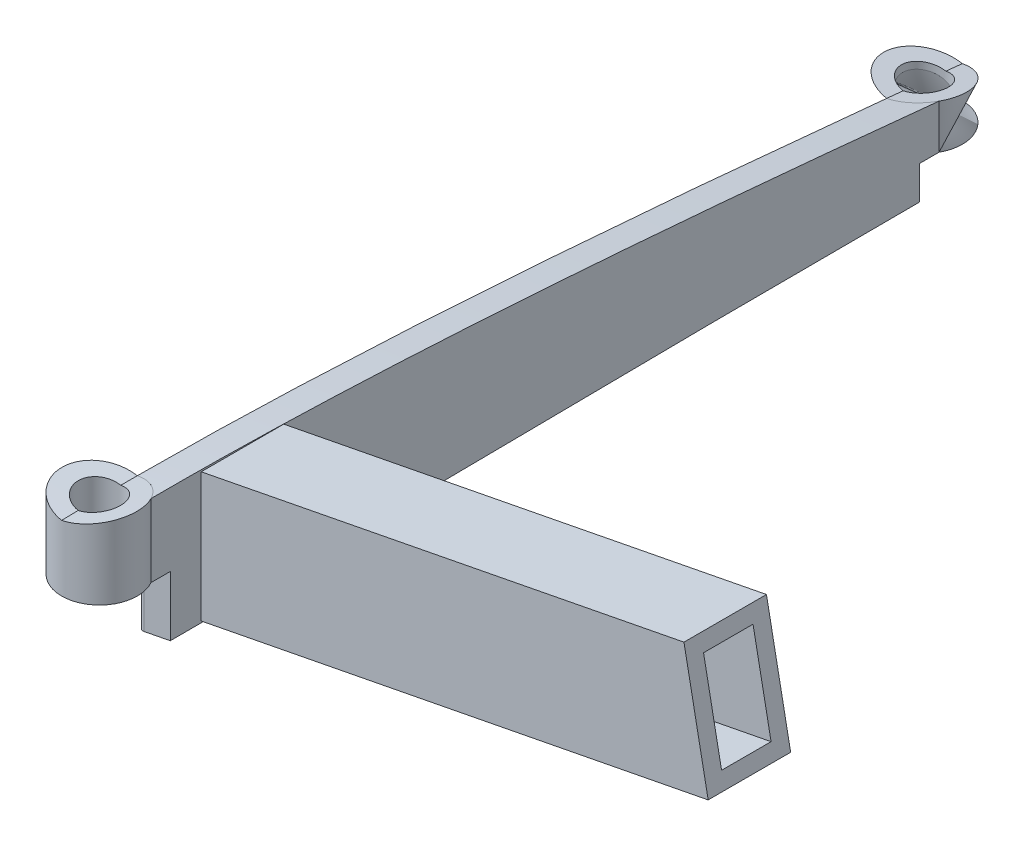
ISO-10303-21;
HEADER;
FILE_DESCRIPTION(('STEP AP214'),'2;1');
FILE_NAME('part.step','',(''),(''),'','','');
FILE_SCHEMA(('AUTOMOTIVE_DESIGN { 1 0 10303 214 1 1 1 1 }'));
ENDSEC;
DATA;
#1=APPLICATION_CONTEXT('core data for automotive mechanical design processes');
#2=APPLICATION_PROTOCOL_DEFINITION('international standard','automotive_design',2000,#1);
#3=PRODUCT_CONTEXT('',#1,'mechanical');
#4=PRODUCT('Part','Part','',(#3));
#5=PRODUCT_RELATED_PRODUCT_CATEGORY('part','',(#4));
#6=PRODUCT_DEFINITION_FORMATION('','',#4);
#7=PRODUCT_DEFINITION_CONTEXT('part definition',#1,'design');
#8=PRODUCT_DEFINITION('design','',#6,#7);
#9=PRODUCT_DEFINITION_SHAPE('','',#8);
#10=(LENGTH_UNIT() NAMED_UNIT(*) SI_UNIT(.MILLI.,.METRE.));
#11=(NAMED_UNIT(*) PLANE_ANGLE_UNIT() SI_UNIT($,.RADIAN.));
#12=(NAMED_UNIT(*) SI_UNIT($,.STERADIAN.) SOLID_ANGLE_UNIT());
#13=UNCERTAINTY_MEASURE_WITH_UNIT(LENGTH_MEASURE(1.E-05),#10,'distance_accuracy_value','');
#14=(GEOMETRIC_REPRESENTATION_CONTEXT(3) GLOBAL_UNCERTAINTY_ASSIGNED_CONTEXT((#13)) GLOBAL_UNIT_ASSIGNED_CONTEXT((#10,
#11,#12)) REPRESENTATION_CONTEXT('',''));
#15=CARTESIAN_POINT('',(0.,0.,0.));
#16=DIRECTION('',(0.,0.,1.));
#17=DIRECTION('',(1.,0.,0.));
#18=AXIS2_PLACEMENT_3D('',#15,#16,#17);
#19=CARTESIAN_POINT('',(0.,14.0330838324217,-7.93030916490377));
#20=CARTESIAN_POINT('',(39.2650873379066,21.6654436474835,-7.93030916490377));
#21=CARTESIAN_POINT('',(0.,14.1778514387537,-8.56036657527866));
#22=CARTESIAN_POINT('',(39.2650873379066,21.8102112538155,-8.56036657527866));
#23=CARTESIAN_POINT('',(0.,14.4430968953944,-9.84080976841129));
#24=CARTESIAN_POINT('',(39.2650873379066,22.0754567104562,-9.84080976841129));
#25=CARTESIAN_POINT('',(0.,14.7761435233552,-11.7909062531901));
#26=CARTESIAN_POINT('',(39.2650873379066,22.408503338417,-11.7909062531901));
#27=CARTESIAN_POINT('',(0.,15.0578193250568,-13.7816396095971));
#28=CARTESIAN_POINT('',(39.2650873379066,22.6901791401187,-13.7816396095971));
#29=CARTESIAN_POINT('',(0.,15.2937601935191,-15.8017719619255));
#30=CARTESIAN_POINT('',(39.2650873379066,22.9261200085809,-15.8017719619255));
#31=CARTESIAN_POINT('',(0.,15.4898728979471,-17.8448093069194));
#32=CARTESIAN_POINT('',(39.2650873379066,23.122232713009,-17.8448093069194));
#33=CARTESIAN_POINT('',(0.,15.6505340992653,-19.9048690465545));
#34=CARTESIAN_POINT('',(39.2650873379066,23.2828939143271,-19.9048690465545));
#35=CARTESIAN_POINT('',(0.,15.7796714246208,-21.9790390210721));
#36=CARTESIAN_POINT('',(39.2650873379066,23.4120312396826,-21.9790390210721));
#37=CARTESIAN_POINT('',(0.,15.8798485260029,-24.0639857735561));
#38=CARTESIAN_POINT('',(39.2650873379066,23.5122083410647,-24.0639857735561));
#39=CARTESIAN_POINT('',(0.,15.9553569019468,-26.1573831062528));
#40=CARTESIAN_POINT('',(39.2650873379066,23.5877167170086,-26.1573831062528));
#41=CARTESIAN_POINT('',(0.,16.0063512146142,-28.2574491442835));
#42=CARTESIAN_POINT('',(39.2650873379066,23.638711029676,-28.2574491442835));
#43=CARTESIAN_POINT('',(0.,16.0368385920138,-30.3627478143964));
#44=CARTESIAN_POINT('',(39.2650873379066,23.6691984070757,-30.3627478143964));
#45=CARTESIAN_POINT('',(0.,16.0468372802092,-32.472924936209));
#46=CARTESIAN_POINT('',(39.2650873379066,23.679197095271,-32.472924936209));
#47=CARTESIAN_POINT('',(0.,16.0385197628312,-34.5871906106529));
#48=CARTESIAN_POINT('',(39.2650873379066,23.670879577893,-34.5871906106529));
#49=CARTESIAN_POINT('',(0.,16.0141932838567,-36.7050492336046));
#50=CARTESIAN_POINT('',(39.2650873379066,23.6465530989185,-36.7050492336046));
#51=CARTESIAN_POINT('',(0.,15.9737064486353,-38.8260674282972));
#52=CARTESIAN_POINT('',(39.2650873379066,23.6060662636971,-38.8260674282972));
#53=CARTESIAN_POINT('',(0.,15.9193336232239,-40.9498371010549));
#54=CARTESIAN_POINT('',(39.2650873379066,23.5516934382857,-40.9498371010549));
#55=CARTESIAN_POINT('',(0.,15.8513941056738,-43.0759701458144));
#56=CARTESIAN_POINT('',(39.2650873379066,23.4837539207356,-43.0759701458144));
#57=CARTESIAN_POINT('',(0.,15.7710829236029,-45.2042482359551));
#58=CARTESIAN_POINT('',(39.2650873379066,23.4034427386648,-45.2042482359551));
#59=CARTESIAN_POINT('',(0.,15.6789432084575,-47.33437937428));
#60=CARTESIAN_POINT('',(39.2650873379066,23.3113030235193,-47.33437937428));
#61=CARTESIAN_POINT('',(0.,15.5763166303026,-49.4662079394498));
#62=CARTESIAN_POINT('',(39.2650873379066,23.2086764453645,-49.4662079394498));
#63=CARTESIAN_POINT('',(0.,15.4638793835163,-51.599402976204));
#64=CARTESIAN_POINT('',(39.2650873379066,23.0962391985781,-51.599402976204));
#65=CARTESIAN_POINT('',(0.,15.3412639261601,-53.7338778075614));
#66=CARTESIAN_POINT('',(39.2650873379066,22.9736237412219,-53.7338778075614));
#67=CARTESIAN_POINT('',(0.,15.2102822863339,-55.8696140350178));
#68=CARTESIAN_POINT('',(39.2650873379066,22.8426421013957,-55.8696140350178));
#69=CARTESIAN_POINT('',(0.,15.0716141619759,-58.006286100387));
#70=CARTESIAN_POINT('',(39.2650873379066,22.7039739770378,-58.006286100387));
#71=CARTESIAN_POINT('',(0.,14.9243494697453,-60.1434521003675));
#72=CARTESIAN_POINT('',(39.2650873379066,22.5567092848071,-60.1434521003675));
#73=CARTESIAN_POINT('',(0.,14.770595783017,-62.2812467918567));
#74=CARTESIAN_POINT('',(39.2650873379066,22.4029555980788,-62.2812467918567));
#75=CARTESIAN_POINT('',(0.,14.6094496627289,-64.4195324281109));
#76=CARTESIAN_POINT('',(39.2650873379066,22.2418094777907,-64.4195324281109));
#77=CARTESIAN_POINT('',(0.,14.4423799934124,-66.5584592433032));
#78=CARTESIAN_POINT('',(39.2650873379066,22.0747398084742,-66.5584592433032));
#79=CARTESIAN_POINT('',(0.,14.2689605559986,-68.6978753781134));
#80=CARTESIAN_POINT('',(39.2650873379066,21.9013203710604,-68.6978753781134));
#81=CARTESIAN_POINT('',(0.,14.0896752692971,-70.8377477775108));
#82=CARTESIAN_POINT('',(39.2650873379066,21.7220350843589,-70.8377477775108));
#83=CARTESIAN_POINT('',(0.,13.9056338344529,-72.9779534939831));
#84=CARTESIAN_POINT('',(39.2650873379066,21.5379936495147,-72.9779534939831));
#85=CARTESIAN_POINT('',(0.,13.7156421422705,-75.1183670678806));
#86=CARTESIAN_POINT('',(39.2650873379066,21.3480019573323,-75.1183670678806));
#87=CARTESIAN_POINT('',(0.,13.5216360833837,-77.2592027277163));
#88=CARTESIAN_POINT('',(39.2650873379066,21.1539958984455,-77.2592027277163));
#89=CARTESIAN_POINT('',(0.,13.3225634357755,-79.4002369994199));
#90=CARTESIAN_POINT('',(39.2650873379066,20.9549232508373,-79.4002369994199));
#91=CARTESIAN_POINT('',(0.,13.1198142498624,-81.5416440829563));
#92=CARTESIAN_POINT('',(39.2650873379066,20.7521740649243,-81.5416440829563));
#93=CARTESIAN_POINT('',(0.,12.9125362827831,-83.6831668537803));
#94=CARTESIAN_POINT('',(39.2650873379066,20.544896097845,-83.6831668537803));
#95=CARTESIAN_POINT('',(0.,12.701997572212,-85.8249209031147));
#96=CARTESIAN_POINT('',(39.2650873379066,20.3343573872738,-85.8249209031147));
#97=CARTESIAN_POINT('',(0.,12.487474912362,-87.9666604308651));
#98=CARTESIAN_POINT('',(39.2650873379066,20.1198347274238,-87.9666604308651));
#99=CARTESIAN_POINT('',(0.,12.2698440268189,-90.1087247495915));
#100=CARTESIAN_POINT('',(39.2650873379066,19.9022038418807,-90.1087247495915));
#101=CARTESIAN_POINT('',(0.,12.0489500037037,-92.2509304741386));
#102=CARTESIAN_POINT('',(39.2650873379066,19.6813098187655,-92.2509304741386));
#103=CARTESIAN_POINT('',(0.,11.8248501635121,-94.3932197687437));
#104=CARTESIAN_POINT('',(39.2650873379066,19.4572099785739,-94.3932197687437));
#105=CARTESIAN_POINT('',(0.,11.5980603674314,-96.5355848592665));
#106=CARTESIAN_POINT('',(39.2650873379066,19.2304201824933,-96.5355848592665));
#107=CARTESIAN_POINT('',(0.,11.3683884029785,-98.6780936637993));
#108=CARTESIAN_POINT('',(39.2650873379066,19.0007482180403,-98.6780936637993));
#109=CARTESIAN_POINT('',(0.,11.13632573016,-100.820740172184));
#110=CARTESIAN_POINT('',(39.2650873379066,18.7686855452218,-100.820740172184));
#111=CARTESIAN_POINT('',(0.,10.9017723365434,-102.963350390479));
#112=CARTESIAN_POINT('',(39.2650873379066,18.5341321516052,-102.963350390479));
#113=CARTESIAN_POINT('',(0.,10.6645796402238,-105.105999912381));
#114=CARTESIAN_POINT('',(39.2650873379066,18.2969394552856,-105.105999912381));
#115=CARTESIAN_POINT('',(0.,10.425543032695,-107.248816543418));
#116=CARTESIAN_POINT('',(39.2650873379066,18.0579028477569,-107.248816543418));
#117=CARTESIAN_POINT('',(0.,10.1845104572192,-109.39177677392));
#118=CARTESIAN_POINT('',(39.2650873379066,17.816870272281,-109.39177677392));
#119=CARTESIAN_POINT('',(0.,9.98090671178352,-111.1842186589));
#120=CARTESIAN_POINT('',(39.2650873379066,17.6132665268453,-111.1842186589));
#121=CARTESIAN_POINT('',(0.,9.85788191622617,-112.262385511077));
#122=CARTESIAN_POINT('',(39.2650873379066,17.490241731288,-112.262385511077));
#123=CARTESIAN_POINT('',(0.,9.81629040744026,-112.626266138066));
#124=CARTESIAN_POINT('',(39.2650873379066,17.4486502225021,-112.626266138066));
#125=B_SPLINE_SURFACE_WITH_KNOTS('',3,1,((#19,#20),(#21,#22),(#23,#24),(#25,#26),(#27,#28),(#29,
#30),(#31,#32),(#33,#34),(#35,#36),(#37,#38),(#39,#40),(#41,#42),(#43,#44),(#45,#46),(#47,#48),
(#49,#50),(#51,#52),(#53,#54),(#55,#56),(#57,#58),(#59,#60),(#61,#62),(#63,#64),(#65,#66),(#67,
#68),(#69,#70),(#71,#72),(#73,#74),(#75,#76),(#77,#78),(#79,#80),(#81,#82),(#83,#84),(#85,#86),
(#87,#88),(#89,#90),(#91,#92),(#93,#94),(#95,#96),(#97,#98),(#99,#100),(#101,#102),(#103,#104),
(#105,#106),(#107,#108),(#109,#110),(#111,#112),(#113,#114),(#115,#116),(#117,#118),(#119,#120),
(#121,#122),(#123,#124)),.UNSPECIFIED.,.F.,.F.,.F.,(4,1,1,1,1,1,1,1,1,1,1,1,1,1,1,1,1,1,1,1,1,1,
1,1,1,1,1,1,1,1,1,1,1,1,1,1,1,1,1,1,1,1,1,1,1,1,1,1,1,1,4),(2,2),(0.,0.0184507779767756,
0.0373147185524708,0.0564582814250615,0.0758319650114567,0.0953626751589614,0.115037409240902,
0.134808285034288,0.15467834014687,0.174615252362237,0.194597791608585,0.21463722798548,
0.23471238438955,0.254828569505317,0.274984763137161,0.295166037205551,0.315379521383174,
0.335623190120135,0.355883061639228,0.376170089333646,0.396480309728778,0.416802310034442,
0.437142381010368,0.457505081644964,0.477877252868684,0.498257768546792,0.518650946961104,
0.539054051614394,0.559464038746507,0.579888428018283,0.600319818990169,0.620756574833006,
0.641201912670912,0.661654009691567,0.682113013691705,0.702577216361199,0.723049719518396,
0.743524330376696,0.764004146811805,0.784487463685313,0.804980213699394,0.82547352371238,
0.84596867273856,0.866471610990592,0.886977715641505,0.907484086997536,0.927993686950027,
0.948509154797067,0.969026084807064,0.989546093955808,1.),(0.,1.),.UNSPECIFIED.);
#126=CARTESIAN_POINT('',(0.,12.4381240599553,-88.45));
#127=CARTESIAN_POINT('',(0.0434419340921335,12.4465682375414,-88.4500006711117));
#128=CARTESIAN_POINT('',(0.0868991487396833,12.4548305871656,-88.4518275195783));
#129=CARTESIAN_POINT('',(0.173585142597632,12.4709409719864,-88.4591357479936));
#130=CARTESIAN_POINT('',(0.216813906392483,12.4787889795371,-88.4646173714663));
#131=CARTESIAN_POINT('',(0.345702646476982,12.5016236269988,-88.4865375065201));
#132=CARTESIAN_POINT('',(0.430624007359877,12.5159123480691,-88.5084512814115));
#133=CARTESIAN_POINT('',(0.595923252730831,12.5421699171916,-88.5664503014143));
#134=CARTESIAN_POINT('',(0.676296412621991,12.5541363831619,-88.6025499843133));
#135=CARTESIAN_POINT('',(0.830012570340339,12.5753546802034,-88.6880158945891));
#136=CARTESIAN_POINT('',(0.903359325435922,12.584607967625,-88.7373749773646));
#137=CARTESIAN_POINT('',(1.03963598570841,12.5999671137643,-88.8470978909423));
#138=CARTESIAN_POINT('',(1.10271961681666,12.606123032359,-88.9072638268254));
#139=CARTESIAN_POINT('',(1.21802321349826,12.6153123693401,-89.0374618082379));
#140=CARTESIAN_POINT('',(1.27024197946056,12.6183454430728,-89.1074949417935));
#141=CARTESIAN_POINT('',(1.3614008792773,12.6211567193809,-89.2540734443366));
#142=CARTESIAN_POINT('',(1.40055816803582,12.6209911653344,-89.3304827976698));
#143=CARTESIAN_POINT('',(1.46571720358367,12.6175456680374,-89.4886423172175));
#144=CARTESIAN_POINT('',(1.49172056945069,12.6142661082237,-89.5703918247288));
#145=CARTESIAN_POINT('',(1.52981136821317,12.6047171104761,-89.7365390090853));
#146=CARTESIAN_POINT('',(1.54195595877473,12.5984601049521,-89.820924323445));
#147=CARTESIAN_POINT('',(1.55229040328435,12.5831572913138,-89.9902915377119));
#148=CARTESIAN_POINT('',(1.55047937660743,12.5741113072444,-90.075273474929));
#149=CARTESIAN_POINT('',(1.53299266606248,12.5533933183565,-90.2444153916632));
#150=CARTESIAN_POINT('',(1.51716690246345,12.5416939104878,-90.3285564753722));
#151=CARTESIAN_POINT('',(1.47204866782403,12.5160795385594,-90.4927779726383));
#152=CARTESIAN_POINT('',(1.44275492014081,12.5021643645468,-90.572858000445));
#153=CARTESIAN_POINT('',(1.37085309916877,12.4721943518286,-90.7285307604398));
#154=CARTESIAN_POINT('',(1.32797747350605,12.4561006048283,-90.8039933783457));
#155=CARTESIAN_POINT('',(1.25490659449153,12.4309056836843,-90.9108116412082));
#156=CARTESIAN_POINT('',(1.2290832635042,12.4223296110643,-90.9453621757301));
#157=CARTESIAN_POINT('',(1.17466746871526,12.4048716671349,-91.012182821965));
#158=CARTESIAN_POINT('',(1.14607246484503,12.3959895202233,-91.0444507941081));
#159=CARTESIAN_POINT('',(1.05515917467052,12.3685961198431,-91.1388000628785));
#160=CARTESIAN_POINT('',(0.988749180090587,12.34969543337,-91.1969106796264));
#161=CARTESIAN_POINT('',(0.847135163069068,12.3114311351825,-91.3009941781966));
#162=CARTESIAN_POINT('',(0.771930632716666,12.2920674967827,-91.3469663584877));
#163=CARTESIAN_POINT('',(0.653565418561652,12.2629453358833,-91.4061806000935));
#164=CARTESIAN_POINT('',(0.612840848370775,12.2531477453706,-91.424398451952));
#165=CARTESIAN_POINT('',(0.529997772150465,12.2336508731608,-91.4572538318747));
#166=CARTESIAN_POINT('',(0.487880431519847,12.2239515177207,-91.4718942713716));
#167=CARTESIAN_POINT('',(0.359888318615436,12.1951082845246,-91.5102592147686));
#168=CARTESIAN_POINT('',(0.272213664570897,12.176179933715,-91.5285071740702));
#169=CARTESIAN_POINT('',(0.153182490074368,12.1515735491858,-91.54271961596));
#170=CARTESIAN_POINT('',(0.122606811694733,12.1453480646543,-91.545449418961));
#171=CARTESIAN_POINT('',(0.0613657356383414,12.1330680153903,-91.5490867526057));
#172=CARTESIAN_POINT('',(0.0307005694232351,12.1270131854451,-91.5499972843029));
#173=CARTESIAN_POINT('',(0.,12.121045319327,-91.55));
#174=B_SPLINE_CURVE_WITH_KNOTS('',3,(#126,#127,#128,#129,#130,#131,#132,#133,#134,#135,#136,
#137,#138,#139,#140,#141,#142,#143,#144,#145,#146,#147,#148,#149,#150,#151,#152,#153,#154,#155,
#156,#157,#158,#159,#160,#161,#162,#163,#164,#165,#166,#167,#168,#169,#170,#171,#172,#173),
.UNSPECIFIED.,.F.,.F.,(4,2,2,2,2,2,2,2,2,2,2,2,2,2,2,2,2,2,2,2,2,2,2,4),(0.,0.132686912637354,
0.265382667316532,0.530596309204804,0.796080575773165,1.06142207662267,1.3223250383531,
1.58325679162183,1.83960466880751,2.09592098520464,2.35117631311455,2.60644774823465,
2.86448631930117,3.12254935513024,3.38605029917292,3.51786011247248,3.64979188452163,
3.9191992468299,4.18862217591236,4.32550587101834,4.46227779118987,4.73527946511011,
4.82921074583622,4.92298695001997),.UNSPECIFIED.);
#175=CARTESIAN_POINT('',(0.,12.4381240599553,-88.45));
#176=VERTEX_POINT('',#175);
#177=CARTESIAN_POINT('',(0.,12.121045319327,-91.55));
#178=VERTEX_POINT('',#177);
#179=EDGE_CURVE('E386',#176,#178,#174,.T.);
#180=CARTESIAN_POINT('',(0.,14.0330838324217,-7.93030916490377));
#181=CARTESIAN_POINT('',(0.,14.1778514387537,-8.56036657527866));
#182=CARTESIAN_POINT('',(0.,14.4430968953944,-9.84080976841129));
#183=CARTESIAN_POINT('',(0.,14.7761435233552,-11.7909062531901));
#184=CARTESIAN_POINT('',(0.,15.0578193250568,-13.7816396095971));
#185=CARTESIAN_POINT('',(0.,15.2937601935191,-15.8017719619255));
#186=CARTESIAN_POINT('',(0.,15.4898728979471,-17.8448093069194));
#187=CARTESIAN_POINT('',(0.,15.6505340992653,-19.9048690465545));
#188=CARTESIAN_POINT('',(0.,15.7796714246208,-21.9790390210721));
#189=CARTESIAN_POINT('',(0.,15.8798485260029,-24.0639857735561));
#190=CARTESIAN_POINT('',(0.,15.9553569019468,-26.1573831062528));
#191=CARTESIAN_POINT('',(0.,16.0063512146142,-28.2574491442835));
#192=CARTESIAN_POINT('',(0.,16.0368385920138,-30.3627478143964));
#193=CARTESIAN_POINT('',(0.,16.0468372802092,-32.472924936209));
#194=CARTESIAN_POINT('',(0.,16.0385197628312,-34.5871906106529));
#195=CARTESIAN_POINT('',(0.,16.0141932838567,-36.7050492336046));
#196=CARTESIAN_POINT('',(0.,15.9737064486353,-38.8260674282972));
#197=CARTESIAN_POINT('',(0.,15.9193336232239,-40.9498371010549));
#198=CARTESIAN_POINT('',(0.,15.8513941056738,-43.0759701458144));
#199=CARTESIAN_POINT('',(0.,15.7710829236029,-45.2042482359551));
#200=CARTESIAN_POINT('',(0.,15.6789432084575,-47.33437937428));
#201=CARTESIAN_POINT('',(0.,15.5763166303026,-49.4662079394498));
#202=CARTESIAN_POINT('',(0.,15.4638793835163,-51.599402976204));
#203=CARTESIAN_POINT('',(0.,15.3412639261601,-53.7338778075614));
#204=CARTESIAN_POINT('',(0.,15.2102822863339,-55.8696140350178));
#205=CARTESIAN_POINT('',(0.,15.0716141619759,-58.006286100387));
#206=CARTESIAN_POINT('',(0.,14.9243494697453,-60.1434521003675));
#207=CARTESIAN_POINT('',(0.,14.770595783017,-62.2812467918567));
#208=CARTESIAN_POINT('',(0.,14.6094496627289,-64.4195324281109));
#209=CARTESIAN_POINT('',(0.,14.4423799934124,-66.5584592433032));
#210=CARTESIAN_POINT('',(0.,14.2689605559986,-68.6978753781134));
#211=CARTESIAN_POINT('',(0.,14.0896752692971,-70.8377477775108));
#212=CARTESIAN_POINT('',(0.,13.9056338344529,-72.9779534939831));
#213=CARTESIAN_POINT('',(0.,13.7156421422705,-75.1183670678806));
#214=CARTESIAN_POINT('',(0.,13.5216360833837,-77.2592027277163));
#215=CARTESIAN_POINT('',(0.,13.3225634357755,-79.4002369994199));
#216=CARTESIAN_POINT('',(0.,13.1198142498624,-81.5416440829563));
#217=CARTESIAN_POINT('',(0.,12.9125362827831,-83.6831668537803));
#218=CARTESIAN_POINT('',(0.,12.701997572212,-85.8249209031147));
#219=CARTESIAN_POINT('',(0.,12.487474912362,-87.9666604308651));
#220=CARTESIAN_POINT('',(0.,12.2698440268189,-90.1087247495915));
#221=CARTESIAN_POINT('',(0.,12.0489500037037,-92.2509304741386));
#222=CARTESIAN_POINT('',(0.,11.8248501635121,-94.3932197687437));
#223=CARTESIAN_POINT('',(0.,11.5980603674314,-96.5355848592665));
#224=CARTESIAN_POINT('',(0.,11.3683884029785,-98.6780936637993));
#225=CARTESIAN_POINT('',(0.,11.13632573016,-100.820740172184));
#226=CARTESIAN_POINT('',(0.,10.9017723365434,-102.963350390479));
#227=CARTESIAN_POINT('',(0.,10.6645796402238,-105.105999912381));
#228=CARTESIAN_POINT('',(0.,10.425543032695,-107.248816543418));
#229=CARTESIAN_POINT('',(0.,10.1845104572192,-109.39177677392));
#230=CARTESIAN_POINT('',(0.,9.98090671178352,-111.1842186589));
#231=CARTESIAN_POINT('',(0.,9.85788191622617,-112.262385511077));
#232=CARTESIAN_POINT('',(0.,9.81629040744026,-112.626266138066));
#233=B_SPLINE_CURVE_WITH_KNOTS('',3,(#180,#181,#182,#183,#184,#185,#186,#187,#188,#189,#190,
#191,#192,#193,#194,#195,#196,#197,#198,#199,#200,#201,#202,#203,#204,#205,#206,#207,#208,#209,
#210,#211,#212,#213,#214,#215,#216,#217,#218,#219,#220,#221,#222,#223,#224,#225,#226,#227,#228,
#229,#230,#231,#232),.UNSPECIFIED.,.F.,.F.,(4,1,1,1,1,1,1,1,1,1,1,1,1,1,1,1,1,1,1,1,1,1,1,1,1,1,
1,1,1,1,1,1,1,1,1,1,1,1,1,1,1,1,1,1,1,1,1,1,1,1,4),(0.136276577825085,0.142480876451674,
0.148824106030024,0.155261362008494,0.161775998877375,0.168343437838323,0.174959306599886,
0.181607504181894,0.188289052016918,0.194993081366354,0.201712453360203,0.208450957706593,
0.215201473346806,0.221965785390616,0.22874355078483,0.235529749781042,0.242326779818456,
0.249133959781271,0.255946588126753,0.262768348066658,0.269597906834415,0.276431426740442,
0.28327102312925,0.290118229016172,0.296968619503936,0.303821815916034,0.310679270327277,
0.317540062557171,0.324403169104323,0.3312711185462,0.338141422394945,0.345013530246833,
0.351888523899,0.35876579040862,0.365645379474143,0.372526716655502,0.379410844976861,
0.386295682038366,0.39318226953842,0.400070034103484,0.406960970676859,0.413852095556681,
0.420743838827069,0.427638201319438,0.434533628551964,0.441429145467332,0.448325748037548,
0.455224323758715,0.462123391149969,0.469023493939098,0.472538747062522),.UNSPECIFIED.);
#234=CARTESIAN_POINT('',(0.,12.5590817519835,-87.25));
#235=VERTEX_POINT('',#234);
#236=EDGE_CURVE('E437',#235,#176,#233,.T.);
#237=CARTESIAN_POINT('',(0.,11.9964973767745,-92.75));
#238=CARTESIAN_POINT('',(0.0792170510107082,12.0118948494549,-92.7500068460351));
#239=CARTESIAN_POINT('',(0.158360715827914,12.0276362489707,-92.7465771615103));
#240=CARTESIAN_POINT('',(0.315936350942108,12.0596874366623,-92.7329339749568));
#241=CARTESIAN_POINT('',(0.394368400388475,12.0759971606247,-92.7227212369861));
#242=CARTESIAN_POINT('',(0.5499076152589,12.1090549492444,-92.6956127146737));
#243=CARTESIAN_POINT('',(0.627015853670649,12.1258026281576,-92.6787226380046));
#244=CARTESIAN_POINT('',(0.779411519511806,12.1596229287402,-92.6384158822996));
#245=CARTESIAN_POINT('',(0.854698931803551,12.176695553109,-92.6149991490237));
#246=CARTESIAN_POINT('',(1.07706175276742,12.2282261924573,-92.5351895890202));
#247=CARTESIAN_POINT('',(1.22075330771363,12.2630215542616,-92.4692170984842));
#248=CARTESIAN_POINT('',(1.49468879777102,12.3324357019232,-92.3137081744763));
#249=CARTESIAN_POINT('',(1.62493369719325,12.3670545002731,-92.2241734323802));
#250=CARTESIAN_POINT('',(1.86900668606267,12.4353262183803,-92.0234589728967));
#251=CARTESIAN_POINT('',(1.98274924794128,12.4689734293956,-91.9121730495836));
#252=CARTESIAN_POINT('',(2.18963085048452,12.5341278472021,-91.6712951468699));
#253=CARTESIAN_POINT('',(2.28276802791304,12.5656348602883,-91.5417015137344));
#254=CARTESIAN_POINT('',(2.44480090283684,12.6252918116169,-91.2690090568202));
#255=CARTESIAN_POINT('',(2.51389797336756,12.653468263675,-91.1260358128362));
#256=CARTESIAN_POINT('',(2.62663319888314,12.7058945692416,-90.8297093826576));
#257=CARTESIAN_POINT('',(2.67027539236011,12.7301450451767,-90.6763578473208));
#258=CARTESIAN_POINT('',(2.72985722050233,12.7734822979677,-90.3669917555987));
#259=CARTESIAN_POINT('',(2.74634862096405,12.7926650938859,-90.2110969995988));
#260=CARTESIAN_POINT('',(2.75256480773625,12.8258861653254,-89.8982241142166));
#261=CARTESIAN_POINT('',(2.74229286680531,12.8399250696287,-89.7412461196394));
#262=CARTESIAN_POINT('',(2.69560081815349,12.8621296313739,-89.4345419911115));
#263=CARTESIAN_POINT('',(2.65979107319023,12.8704236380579,-89.2847321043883));
#264=CARTESIAN_POINT('',(2.56360011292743,12.8813882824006,-88.9930064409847));
#265=CARTESIAN_POINT('',(2.50322141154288,12.8840594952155,-88.8510898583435));
#266=CARTESIAN_POINT('',(2.3606989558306,12.8837025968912,-88.5813658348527));
#267=CARTESIAN_POINT('',(2.2788927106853,12.8807587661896,-88.4533797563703));
#268=CARTESIAN_POINT('',(2.09550290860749,12.8694452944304,-88.2127541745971));
#269=CARTESIAN_POINT('',(1.99392085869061,12.8610760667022,-88.1001135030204));
#270=CARTESIAN_POINT('',(1.77400027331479,12.8391959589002,-87.8932956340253));
#271=CARTESIAN_POINT('',(1.65566800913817,12.825686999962,-87.7991115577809));
#272=CARTESIAN_POINT('',(1.40559253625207,12.7939504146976,-87.631568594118));
#273=CARTESIAN_POINT('',(1.27384430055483,12.7757210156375,-87.5582175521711));
#274=CARTESIAN_POINT('',(0.998718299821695,12.7348087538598,-87.4332432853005));
#275=CARTESIAN_POINT('',(0.855198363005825,12.7120645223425,-87.3819543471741));
#276=CARTESIAN_POINT('',(0.562364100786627,12.6629869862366,-87.3038649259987));
#277=CARTESIAN_POINT('',(0.413058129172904,12.6366587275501,-87.2770304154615));
#278=CARTESIAN_POINT('',(0.21923210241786,12.6008532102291,-87.2583975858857));
#279=CARTESIAN_POINT('',(0.175376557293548,12.5926450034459,-87.2552451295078));
#280=CARTESIAN_POINT('',(0.0876795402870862,12.5760196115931,-87.2510492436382));
#281=CARTESIAN_POINT('',(0.0438381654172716,12.5676027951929,-87.2500023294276));
#282=CARTESIAN_POINT('',(0.,12.5590817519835,-87.25));
#283=B_SPLINE_CURVE_WITH_KNOTS('',3,(#237,#238,#239,#240,#241,#242,#243,#244,#245,#246,#247,
#248,#249,#250,#251,#252,#253,#254,#255,#256,#257,#258,#259,#260,#261,#262,#263,#264,#265,#266,
#267,#268,#269,#270,#271,#272,#273,#274,#275,#276,#277,#278,#279,#280,#281,#282),.UNSPECIFIED.,
.F.,.F.,(4,2,2,2,2,2,2,2,2,2,2,2,2,2,2,2,2,2,2,2,2,2,4),(0.,0.242014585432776,0.484001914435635,
0.725782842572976,0.967565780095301,1.45077651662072,1.93395257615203,2.41954962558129,
2.90519056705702,3.38665961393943,3.86805225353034,4.33953539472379,4.81096088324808,
5.27148123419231,5.73195447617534,6.18557047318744,6.63915191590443,7.09256398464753,
7.54614657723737,8.00637855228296,8.46596914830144,8.60012120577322,8.73405105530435),.UNSPECIFIED.);
#284=CARTESIAN_POINT('',(0.,11.9964973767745,-92.7499999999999));
#285=VERTEX_POINT('',#284);
#286=EDGE_CURVE('E302',#285,#235,#283,.T.);
#287=EDGE_CURVE('E431',#178,#285,#233,.T.);
#288=ORIENTED_EDGE('',*,*,#179,.F.);
#289=ORIENTED_EDGE('',*,*,#236,.F.);
#290=ORIENTED_EDGE('',*,*,#286,.F.);
#291=ORIENTED_EDGE('',*,*,#287,.F.);
#292=EDGE_LOOP('',(#288,#289,#290,#291));
#293=FACE_BOUND('',#292,.T.);
#294=ADVANCED_FACE('F38',(#293),#125,.F.);
#295=CARTESIAN_POINT('',(0.,16.006561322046,-28.45));
#296=CARTESIAN_POINT('',(0.0443114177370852,16.0151745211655,-28.4500007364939));
#297=CARTESIAN_POINT('',(0.0885949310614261,16.0238175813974,-28.4519012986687));
#298=CARTESIAN_POINT('',(0.176834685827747,16.0411096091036,-28.4594829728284));
#299=CARTESIAN_POINT('',(0.220790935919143,16.0497585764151,-28.4651639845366));
#300=CARTESIAN_POINT('',(0.351665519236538,16.0756146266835,-28.4878319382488));
#301=CARTESIAN_POINT('',(0.437692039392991,16.0927507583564,-28.5104438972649));
#302=CARTESIAN_POINT('',(0.604752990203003,16.1263013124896,-28.5700855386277));
#303=CARTESIAN_POINT('',(0.685784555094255,16.1427153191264,-28.6071234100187));
#304=CARTESIAN_POINT('',(0.840485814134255,16.1743217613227,-28.6946366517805));
#305=CARTESIAN_POINT('',(0.914157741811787,16.1895145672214,-28.7451079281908));
#306=CARTESIAN_POINT('',(1.05147485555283,16.2181038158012,-28.8577502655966));
#307=CARTESIAN_POINT('',(1.11518500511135,16.2315118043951,-28.9198391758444));
#308=CARTESIAN_POINT('',(1.23123331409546,16.2562176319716,-29.0542484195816));
#309=CARTESIAN_POINT('',(1.28357066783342,16.2675153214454,-29.1265694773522));
#310=CARTESIAN_POINT('',(1.37437388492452,16.2874345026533,-29.278020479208));
#311=CARTESIAN_POINT('',(1.41306879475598,16.296099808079,-29.3570073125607));
#312=CARTESIAN_POINT('',(1.4766074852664,16.3107221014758,-29.5205974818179));
#313=CARTESIAN_POINT('',(1.5014537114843,16.3166795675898,-29.605199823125));
#314=CARTESIAN_POINT('',(1.53614730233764,16.3255943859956,-29.7759442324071));
#315=CARTESIAN_POINT('',(1.54626321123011,16.328605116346,-29.8620290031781));
#316=CARTESIAN_POINT('',(1.55201724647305,16.3317139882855,-30.0347324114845));
#317=CARTESIAN_POINT('',(1.54765614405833,16.3318122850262,-30.1213510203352));
#318=CARTESIAN_POINT('',(1.52470012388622,16.3291097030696,-30.2917201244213));
#319=CARTESIAN_POINT('',(1.50625279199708,16.3263387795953,-30.3754910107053));
#320=CARTESIAN_POINT('',(1.45587855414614,16.318044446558,-30.5387178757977));
#321=CARTESIAN_POINT('',(1.42395170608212,16.3125210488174,-30.6181738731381));
#322=CARTESIAN_POINT('',(1.34745506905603,16.2988863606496,-30.7708201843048));
#323=CARTESIAN_POINT('',(1.30285127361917,16.2907681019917,-30.8439929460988));
#324=CARTESIAN_POINT('',(1.22758326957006,16.276871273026,-30.9472918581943));
#325=CARTESIAN_POINT('',(1.20109383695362,16.2719512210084,-30.9806543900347));
#326=CARTESIAN_POINT('',(1.1454838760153,16.2615704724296,-31.0450733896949));
#327=CARTESIAN_POINT('',(1.11636100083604,16.256109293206,-31.0761277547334));
#328=CARTESIAN_POINT('',(1.0245626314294,16.238828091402,-31.1662679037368));
#329=CARTESIAN_POINT('',(0.95810856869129,16.2262307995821,-31.2214380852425));
#330=CARTESIAN_POINT('',(0.81720211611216,16.199384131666,-31.3198749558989));
#331=CARTESIAN_POINT('',(0.742748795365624,16.1851345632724,-31.3631402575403));
#332=CARTESIAN_POINT('',(0.62592238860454,16.162700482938,-31.4186739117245));
#333=CARTESIAN_POINT('',(0.585688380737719,16.154961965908,-31.4357477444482));
#334=CARTESIAN_POINT('',(0.504010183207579,16.1392301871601,-31.4664164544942));
#335=CARTESIAN_POINT('',(0.462567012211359,16.1312371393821,-31.4800141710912));
#336=CARTESIAN_POINT('',(0.33685757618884,16.10696285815,-31.5154467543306));
#337=CARTESIAN_POINT('',(0.251062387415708,16.0903578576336,-31.5319916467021));
#338=CARTESIAN_POINT('',(0.13729171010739,16.0682957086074,-31.5441550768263));
#339=CARTESIAN_POINT('',(0.10985278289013,16.06297158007,-31.5463481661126));
#340=CARTESIAN_POINT('',(0.0549471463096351,16.0523115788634,-31.5492682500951));
#341=CARTESIAN_POINT('',(0.0274805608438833,16.0469757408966,-31.5499976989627));
#342=CARTESIAN_POINT('',(0.,16.0416340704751,-31.55));
#343=B_SPLINE_CURVE_WITH_KNOTS('',3,(#295,#296,#297,#298,#299,#300,#301,#302,#303,#304,#305,
#306,#307,#308,#309,#310,#311,#312,#313,#314,#315,#316,#317,#318,#319,#320,#321,#322,#323,#324,
#325,#326,#327,#328,#329,#330,#331,#332,#333,#334,#335,#336,#337,#338,#339,#340,#341,#342),
.UNSPECIFIED.,.F.,.F.,(4,2,2,2,2,2,2,2,2,2,2,2,2,2,2,2,2,2,2,2,2,2,2,4),(0.,0.135339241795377,
0.270674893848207,0.541037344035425,0.811553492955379,1.08198729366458,1.35057650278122,
1.61918473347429,1.88304043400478,2.14684952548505,2.40578622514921,2.66470913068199,
2.92095582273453,3.17720141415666,3.43414099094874,3.56266424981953,3.69130319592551,
3.95187397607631,4.2124751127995,4.34549555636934,4.47840699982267,4.74373365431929,
4.8278202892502,4.91176581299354),.UNSPECIFIED.);
#344=CARTESIAN_POINT('',(0.,16.006561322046,-28.45));
#345=VERTEX_POINT('',#344);
#346=CARTESIAN_POINT('',(0.,16.0416340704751,-31.55));
#347=VERTEX_POINT('',#346);
#348=EDGE_CURVE('E349',#345,#347,#343,.T.);
#349=CARTESIAN_POINT('',(0.,15.9809499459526,-27.25));
#350=VERTEX_POINT('',#349);
#351=EDGE_CURVE('E438',#350,#345,#233,.T.);
#352=CARTESIAN_POINT('',(0.,16.0437387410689,-32.75));
#353=CARTESIAN_POINT('',(0.0784082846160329,16.0589794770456,-32.7500065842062));
#354=CARTESIAN_POINT('',(0.15681292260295,16.0742225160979,-32.7466466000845));
#355=CARTESIAN_POINT('',(0.313068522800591,16.104604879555,-32.7332449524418));
#356=CARTESIAN_POINT('',(0.390919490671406,16.1197442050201,-32.7232033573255));
#357=CARTESIAN_POINT('',(0.545512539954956,16.1498091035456,-32.6964917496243));
#358=CARTESIAN_POINT('',(0.622254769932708,16.1647347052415,-32.679822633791));
#359=CARTESIAN_POINT('',(0.774070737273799,16.1942591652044,-32.6399776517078));
#360=CARTESIAN_POINT('',(0.849144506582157,16.2088580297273,-32.6168019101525));
#361=CARTESIAN_POINT('',(1.07116111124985,16.2520201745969,-32.5376667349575));
#362=CARTESIAN_POINT('',(1.21493539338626,16.2799560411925,-32.4720930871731));
#363=CARTESIAN_POINT('',(1.48939631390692,16.3331936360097,-32.3171229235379));
#364=CARTESIAN_POINT('',(1.62008749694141,16.3584962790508,-32.2277347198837));
#365=CARTESIAN_POINT('',(1.86350251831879,16.4054458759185,-32.0283906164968));
#366=CARTESIAN_POINT('',(1.97637672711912,16.4271235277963,-31.9186260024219));
#367=CARTESIAN_POINT('',(2.182062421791,16.4663396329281,-31.681010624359));
#368=CARTESIAN_POINT('',(2.27487253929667,16.483877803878,-31.5531586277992));
#369=CARTESIAN_POINT('',(2.43589139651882,16.5138744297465,-31.2856284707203));
#370=CARTESIAN_POINT('',(2.50453680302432,16.5264236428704,-31.1462233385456));
#371=CARTESIAN_POINT('',(2.61746692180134,16.5464395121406,-30.8575425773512));
#372=CARTESIAN_POINT('',(2.66175598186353,16.5539070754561,-30.7082687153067));
#373=CARTESIAN_POINT('',(2.72400115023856,16.5633785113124,-30.4069117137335));
#374=CARTESIAN_POINT('',(2.7424070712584,16.565476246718,-30.2549242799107));
#375=CARTESIAN_POINT('',(2.75377335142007,16.5643892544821,-29.9500165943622));
#376=CARTESIAN_POINT('',(2.74673463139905,16.5612047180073,-29.7970963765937));
#377=CARTESIAN_POINT('',(2.70762554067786,16.5497085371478,-29.4958279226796));
#378=CARTESIAN_POINT('',(2.67573365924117,16.5414335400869,-29.3474548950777));
#379=CARTESIAN_POINT('',(2.58811435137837,16.5200687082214,-29.0582100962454));
#380=CARTESIAN_POINT('',(2.53238646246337,16.5069787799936,-28.9173384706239));
#381=CARTESIAN_POINT('',(2.43208977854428,16.4840434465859,-28.714221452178));
#382=CARTESIAN_POINT('',(2.39569308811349,16.4758084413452,-28.6476300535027));
#383=CARTESIAN_POINT('',(2.31759354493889,16.4583075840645,-28.5177748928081));
#384=CARTESIAN_POINT('',(2.27589181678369,16.4490419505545,-28.4545104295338));
#385=CARTESIAN_POINT('',(2.18750433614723,16.4295598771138,-28.3317542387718));
#386=CARTESIAN_POINT('',(2.14082023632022,16.4193437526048,-28.2722612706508));
#387=CARTESIAN_POINT('',(2.04277056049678,16.3980353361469,-28.1573650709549));
#388=CARTESIAN_POINT('',(1.99140080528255,16.3869422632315,-28.101965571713));
#389=CARTESIAN_POINT('',(1.82902539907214,16.3520963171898,-27.940714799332));
#390=CARTESIAN_POINT('',(1.71121198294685,16.3270987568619,-27.8418355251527));
#391=CARTESIAN_POINT('',(1.46114310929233,16.2746438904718,-27.6652630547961));
#392=CARTESIAN_POINT('',(1.32888598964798,16.2471863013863,-27.5875723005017));
#393=CARTESIAN_POINT('',(1.12114332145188,16.2045148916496,-27.4877047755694));
#394=CARTESIAN_POINT('',(1.04954018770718,16.1898832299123,-27.456964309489));
#395=CARTESIAN_POINT('',(0.904084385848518,16.1603165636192,-27.4016982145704));
#396=CARTESIAN_POINT('',(0.83023360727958,16.1453818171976,-27.3771675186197));
#397=CARTESIAN_POINT('',(0.680831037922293,16.1153263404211,-27.3344788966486));
#398=CARTESIAN_POINT('',(0.605280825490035,16.1002057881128,-27.3163152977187));
#399=CARTESIAN_POINT('',(0.452945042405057,16.0698766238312,-27.2864485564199));
#400=CARTESIAN_POINT('',(0.376159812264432,16.0546680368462,-27.274743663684));
#401=CARTESIAN_POINT('',(0.249347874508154,16.0296822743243,-27.2608715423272));
#402=CARTESIAN_POINT('',(0.199523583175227,16.019898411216,-27.2567924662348));
#403=CARTESIAN_POINT('',(0.0998032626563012,16.000382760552,-27.2513587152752));
#404=CARTESIAN_POINT('',(0.0499074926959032,15.9906509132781,-27.2499994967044));
#405=CARTESIAN_POINT('',(0.,15.9809499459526,-27.25));
#406=B_SPLINE_CURVE_WITH_KNOTS('',3,(#352,#353,#354,#355,#356,#357,#358,#359,#360,#361,#362,
#363,#364,#365,#366,#367,#368,#369,#370,#371,#372,#373,#374,#375,#376,#377,#378,#379,#380,#381,
#382,#383,#384,#385,#386,#387,#388,#389,#390,#391,#392,#393,#394,#395,#396,#397,#398,#399,#400,
#401,#402,#403,#404,#405),.UNSPECIFIED.,.F.,.F.,(4,2,2,2,2,2,2,2,2,2,2,2,2,2,2,2,2,2,2,2,2,2,2,
2,2,2,4),(0.,0.239550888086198,0.479099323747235,0.718615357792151,0.95812680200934,
1.43703903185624,1.9157843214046,2.39024387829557,2.86473578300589,3.33015050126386,
3.79548211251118,4.25262253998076,4.7097464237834,5.16361727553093,5.61749693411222,
5.84628249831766,6.07501964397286,6.30368115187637,6.53254863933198,6.99773781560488,
7.46298058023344,7.70060264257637,7.93803017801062,8.17524563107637,8.41239676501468,
8.56514761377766,8.71764306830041),.UNSPECIFIED.);
#407=CARTESIAN_POINT('',(0.,16.0437387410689,-32.7499999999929));
#408=VERTEX_POINT('',#407);
#409=EDGE_CURVE('E340',#408,#350,#406,.T.);
#410=EDGE_CURVE('E439',#347,#408,#233,.T.);
#411=ORIENTED_EDGE('',*,*,#348,.F.);
#412=ORIENTED_EDGE('',*,*,#351,.F.);
#413=ORIENTED_EDGE('',*,*,#409,.F.);
#414=ORIENTED_EDGE('',*,*,#410,.F.);
#415=EDGE_LOOP('',(#411,#412,#413,#414));
#416=FACE_BOUND('',#415,.T.);
#417=ADVANCED_FACE('F321',(#416),#125,.F.);
#418=CARTESIAN_POINT('',(0.,14.0330838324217,-7.93030916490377));
#419=CARTESIAN_POINT('',(-39.2650873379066,21.6654436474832,-7.93030916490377));
#420=CARTESIAN_POINT('',(0.,14.1778514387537,-8.56036657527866));
#421=CARTESIAN_POINT('',(-39.2650873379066,21.8102112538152,-8.56036657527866));
#422=CARTESIAN_POINT('',(0.,14.4430968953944,-9.84080976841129));
#423=CARTESIAN_POINT('',(-39.2650873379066,22.075456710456,-9.84080976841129));
#424=CARTESIAN_POINT('',(0.,14.7761435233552,-11.7909062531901));
#425=CARTESIAN_POINT('',(-39.2650873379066,22.4085033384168,-11.7909062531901));
#426=CARTESIAN_POINT('',(0.,15.0578193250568,-13.7816396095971));
#427=CARTESIAN_POINT('',(-39.2650873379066,22.6901791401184,-13.7816396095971));
#428=CARTESIAN_POINT('',(0.,15.2937601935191,-15.8017719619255));
#429=CARTESIAN_POINT('',(-39.2650873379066,22.9261200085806,-15.8017719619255));
#430=CARTESIAN_POINT('',(0.,15.4898728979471,-17.8448093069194));
#431=CARTESIAN_POINT('',(-39.2650873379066,23.1222327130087,-17.8448093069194));
#432=CARTESIAN_POINT('',(0.,15.6505340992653,-19.9048690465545));
#433=CARTESIAN_POINT('',(-39.2650873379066,23.2828939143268,-19.9048690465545));
#434=CARTESIAN_POINT('',(0.,15.7796714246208,-21.9790390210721));
#435=CARTESIAN_POINT('',(-39.2650873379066,23.4120312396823,-21.9790390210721));
#436=CARTESIAN_POINT('',(0.,15.8798485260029,-24.0639857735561));
#437=CARTESIAN_POINT('',(-39.2650873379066,23.5122083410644,-24.0639857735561));
#438=CARTESIAN_POINT('',(0.,15.9553569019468,-26.1573831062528));
#439=CARTESIAN_POINT('',(-39.2650873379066,23.5877167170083,-26.1573831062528));
#440=CARTESIAN_POINT('',(0.,16.0063512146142,-28.2574491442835));
#441=CARTESIAN_POINT('',(-39.2650873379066,23.6387110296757,-28.2574491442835));
#442=CARTESIAN_POINT('',(0.,16.0368385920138,-30.3627478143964));
#443=CARTESIAN_POINT('',(-39.2650873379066,23.6691984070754,-30.3627478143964));
#444=CARTESIAN_POINT('',(0.,16.0468372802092,-32.472924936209));
#445=CARTESIAN_POINT('',(-39.2650873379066,23.6791970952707,-32.472924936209));
#446=CARTESIAN_POINT('',(0.,16.0385197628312,-34.5871906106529));
#447=CARTESIAN_POINT('',(-39.2650873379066,23.6708795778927,-34.5871906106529));
#448=CARTESIAN_POINT('',(0.,16.0141932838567,-36.7050492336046));
#449=CARTESIAN_POINT('',(-39.2650873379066,23.6465530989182,-36.7050492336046));
#450=CARTESIAN_POINT('',(0.,15.9737064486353,-38.8260674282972));
#451=CARTESIAN_POINT('',(-39.2650873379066,23.6060662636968,-38.8260674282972));
#452=CARTESIAN_POINT('',(0.,15.9193336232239,-40.9498371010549));
#453=CARTESIAN_POINT('',(-39.2650873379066,23.5516934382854,-40.9498371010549));
#454=CARTESIAN_POINT('',(0.,15.8513941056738,-43.0759701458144));
#455=CARTESIAN_POINT('',(-39.2650873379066,23.4837539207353,-43.0759701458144));
#456=CARTESIAN_POINT('',(0.,15.7710829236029,-45.2042482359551));
#457=CARTESIAN_POINT('',(-39.2650873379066,23.4034427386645,-45.2042482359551));
#458=CARTESIAN_POINT('',(0.,15.6789432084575,-47.33437937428));
#459=CARTESIAN_POINT('',(-39.2650873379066,23.311303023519,-47.33437937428));
#460=CARTESIAN_POINT('',(0.,15.5763166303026,-49.4662079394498));
#461=CARTESIAN_POINT('',(-39.2650873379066,23.2086764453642,-49.4662079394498));
#462=CARTESIAN_POINT('',(0.,15.4638793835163,-51.599402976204));
#463=CARTESIAN_POINT('',(-39.2650873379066,23.0962391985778,-51.599402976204));
#464=CARTESIAN_POINT('',(0.,15.3412639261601,-53.7338778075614));
#465=CARTESIAN_POINT('',(-39.2650873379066,22.9736237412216,-53.7338778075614));
#466=CARTESIAN_POINT('',(0.,15.2102822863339,-55.8696140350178));
#467=CARTESIAN_POINT('',(-39.2650873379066,22.8426421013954,-55.8696140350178));
#468=CARTESIAN_POINT('',(0.,15.0716141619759,-58.006286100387));
#469=CARTESIAN_POINT('',(-39.2650873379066,22.7039739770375,-58.006286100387));
#470=CARTESIAN_POINT('',(0.,14.9243494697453,-60.1434521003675));
#471=CARTESIAN_POINT('',(-39.2650873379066,22.5567092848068,-60.1434521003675));
#472=CARTESIAN_POINT('',(0.,14.770595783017,-62.2812467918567));
#473=CARTESIAN_POINT('',(-39.2650873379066,22.4029555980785,-62.2812467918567));
#474=CARTESIAN_POINT('',(0.,14.6094496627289,-64.4195324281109));
#475=CARTESIAN_POINT('',(-39.2650873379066,22.2418094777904,-64.4195324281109));
#476=CARTESIAN_POINT('',(0.,14.4423799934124,-66.5584592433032));
#477=CARTESIAN_POINT('',(-39.2650873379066,22.0747398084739,-66.5584592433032));
#478=CARTESIAN_POINT('',(0.,14.2689605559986,-68.6978753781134));
#479=CARTESIAN_POINT('',(-39.2650873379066,21.9013203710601,-68.6978753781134));
#480=CARTESIAN_POINT('',(0.,14.0896752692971,-70.8377477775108));
#481=CARTESIAN_POINT('',(-39.2650873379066,21.7220350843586,-70.8377477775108));
#482=CARTESIAN_POINT('',(0.,13.9056338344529,-72.9779534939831));
#483=CARTESIAN_POINT('',(-39.2650873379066,21.5379936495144,-72.9779534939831));
#484=CARTESIAN_POINT('',(0.,13.7156421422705,-75.1183670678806));
#485=CARTESIAN_POINT('',(-39.2650873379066,21.348001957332,-75.1183670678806));
#486=CARTESIAN_POINT('',(0.,13.5216360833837,-77.2592027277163));
#487=CARTESIAN_POINT('',(-39.2650873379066,21.1539958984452,-77.2592027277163));
#488=CARTESIAN_POINT('',(0.,13.3225634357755,-79.4002369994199));
#489=CARTESIAN_POINT('',(-39.2650873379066,20.954923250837,-79.4002369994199));
#490=CARTESIAN_POINT('',(0.,13.1198142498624,-81.5416440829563));
#491=CARTESIAN_POINT('',(-39.2650873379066,20.752174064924,-81.5416440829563));
#492=CARTESIAN_POINT('',(0.,12.9125362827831,-83.6831668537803));
#493=CARTESIAN_POINT('',(-39.2650873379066,20.5448960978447,-83.6831668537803));
#494=CARTESIAN_POINT('',(0.,12.701997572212,-85.8249209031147));
#495=CARTESIAN_POINT('',(-39.2650873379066,20.3343573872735,-85.8249209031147));
#496=CARTESIAN_POINT('',(0.,12.487474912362,-87.9666604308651));
#497=CARTESIAN_POINT('',(-39.2650873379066,20.1198347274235,-87.9666604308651));
#498=CARTESIAN_POINT('',(0.,12.2698440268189,-90.1087247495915));
#499=CARTESIAN_POINT('',(-39.2650873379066,19.9022038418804,-90.1087247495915));
#500=CARTESIAN_POINT('',(0.,12.0489500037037,-92.2509304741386));
#501=CARTESIAN_POINT('',(-39.2650873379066,19.6813098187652,-92.2509304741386));
#502=CARTESIAN_POINT('',(0.,11.8248501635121,-94.3932197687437));
#503=CARTESIAN_POINT('',(-39.2650873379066,19.4572099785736,-94.3932197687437));
#504=CARTESIAN_POINT('',(0.,11.5980603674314,-96.5355848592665));
#505=CARTESIAN_POINT('',(-39.2650873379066,19.230420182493,-96.5355848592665));
#506=CARTESIAN_POINT('',(0.,11.3683884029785,-98.6780936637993));
#507=CARTESIAN_POINT('',(-39.2650873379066,19.00074821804,-98.6780936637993));
#508=CARTESIAN_POINT('',(0.,11.13632573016,-100.820740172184));
#509=CARTESIAN_POINT('',(-39.2650873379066,18.7686855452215,-100.820740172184));
#510=CARTESIAN_POINT('',(0.,10.9017723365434,-102.963350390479));
#511=CARTESIAN_POINT('',(-39.2650873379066,18.5341321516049,-102.963350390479));
#512=CARTESIAN_POINT('',(0.,10.6645796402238,-105.105999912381));
#513=CARTESIAN_POINT('',(-39.2650873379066,18.2969394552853,-105.105999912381));
#514=CARTESIAN_POINT('',(0.,10.425543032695,-107.248816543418));
#515=CARTESIAN_POINT('',(-39.2650873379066,18.0579028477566,-107.248816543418));
#516=CARTESIAN_POINT('',(0.,10.1845104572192,-109.39177677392));
#517=CARTESIAN_POINT('',(-39.2650873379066,17.8168702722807,-109.39177677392));
#518=CARTESIAN_POINT('',(0.,9.98090671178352,-111.1842186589));
#519=CARTESIAN_POINT('',(-39.2650873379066,17.613266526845,-111.1842186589));
#520=CARTESIAN_POINT('',(0.,9.85788191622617,-112.262385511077));
#521=CARTESIAN_POINT('',(-39.2650873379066,17.4902417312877,-112.262385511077));
#522=CARTESIAN_POINT('',(0.,9.81629040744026,-112.626266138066));
#523=CARTESIAN_POINT('',(-39.2650873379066,17.4486502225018,-112.626266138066));
#524=B_SPLINE_SURFACE_WITH_KNOTS('',3,1,((#418,#419),(#420,#421),(#422,#423),(#424,#425),(#426,
#427),(#428,#429),(#430,#431),(#432,#433),(#434,#435),(#436,#437),(#438,#439),(#440,#441),(#442,
#443),(#444,#445),(#446,#447),(#448,#449),(#450,#451),(#452,#453),(#454,#455),(#456,#457),(#458,
#459),(#460,#461),(#462,#463),(#464,#465),(#466,#467),(#468,#469),(#470,#471),(#472,#473),(#474,
#475),(#476,#477),(#478,#479),(#480,#481),(#482,#483),(#484,#485),(#486,#487),(#488,#489),(#490,
#491),(#492,#493),(#494,#495),(#496,#497),(#498,#499),(#500,#501),(#502,#503),(#504,#505),(#506,
#507),(#508,#509),(#510,#511),(#512,#513),(#514,#515),(#516,#517),(#518,#519),(#520,#521),(#522,
#523)),.UNSPECIFIED.,.F.,.F.,.F.,(4,1,1,1,1,1,1,1,1,1,1,1,1,1,1,1,1,1,1,1,1,1,1,1,1,1,1,1,1,1,1,
1,1,1,1,1,1,1,1,1,1,1,1,1,1,1,1,1,1,1,4),(2,2),(0.,0.0184507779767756,0.0373147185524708,
0.0564582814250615,0.0758319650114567,0.0953626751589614,0.115037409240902,0.134808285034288,
0.15467834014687,0.174615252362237,0.194597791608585,0.21463722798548,0.23471238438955,
0.254828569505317,0.274984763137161,0.295166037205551,0.315379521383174,0.335623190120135,
0.355883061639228,0.376170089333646,0.396480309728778,0.416802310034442,0.437142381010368,
0.457505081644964,0.477877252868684,0.498257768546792,0.518650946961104,0.539054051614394,
0.559464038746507,0.579888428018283,0.600319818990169,0.620756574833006,0.641201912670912,
0.661654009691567,0.682113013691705,0.702577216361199,0.723049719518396,0.743524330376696,
0.764004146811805,0.784487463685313,0.804980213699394,0.82547352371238,0.84596867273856,
0.866471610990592,0.886977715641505,0.907484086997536,0.927993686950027,0.948509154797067,
0.969026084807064,0.989546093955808,1.),(0.,1.),.UNSPECIFIED.);
#525=CARTESIAN_POINT('',(0.,16.006561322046,-28.45));
#526=CARTESIAN_POINT('',(-0.0443114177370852,16.0151745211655,-28.4500007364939));
#527=CARTESIAN_POINT('',(-0.0885949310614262,16.0238175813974,-28.4519012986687));
#528=CARTESIAN_POINT('',(-0.176834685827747,16.0411096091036,-28.4594829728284));
#529=CARTESIAN_POINT('',(-0.220790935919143,16.0497585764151,-28.4651639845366));
#530=CARTESIAN_POINT('',(-0.351665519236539,16.0756146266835,-28.4878319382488));
#531=CARTESIAN_POINT('',(-0.437692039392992,16.0927507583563,-28.5104438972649));
#532=CARTESIAN_POINT('',(-0.604752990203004,16.1263013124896,-28.5700855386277));
#533=CARTESIAN_POINT('',(-0.685784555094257,16.1427153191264,-28.6071234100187));
#534=CARTESIAN_POINT('',(-0.840485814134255,16.1743217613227,-28.6946366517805));
#535=CARTESIAN_POINT('',(-0.914157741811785,16.1895145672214,-28.7451079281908));
#536=CARTESIAN_POINT('',(-1.05147485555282,16.2181038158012,-28.8577502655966));
#537=CARTESIAN_POINT('',(-1.11518500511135,16.2315118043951,-28.9198391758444));
#538=CARTESIAN_POINT('',(-1.23123331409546,16.2562176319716,-29.0542484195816));
#539=CARTESIAN_POINT('',(-1.28357066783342,16.2675153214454,-29.1265694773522));
#540=CARTESIAN_POINT('',(-1.37437388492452,16.2874345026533,-29.278020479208));
#541=CARTESIAN_POINT('',(-1.41306879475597,16.296099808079,-29.3570073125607));
#542=CARTESIAN_POINT('',(-1.4766074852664,16.3107221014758,-29.5205974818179));
#543=CARTESIAN_POINT('',(-1.5014537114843,16.3166795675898,-29.605199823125));
#544=CARTESIAN_POINT('',(-1.53614730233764,16.3255943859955,-29.7759442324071));
#545=CARTESIAN_POINT('',(-1.54626321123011,16.3286051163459,-29.8620290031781));
#546=CARTESIAN_POINT('',(-1.55201724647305,16.3317139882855,-30.0347324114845));
#547=CARTESIAN_POINT('',(-1.54765614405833,16.3318122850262,-30.1213510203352));
#548=CARTESIAN_POINT('',(-1.52470012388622,16.3291097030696,-30.2917201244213));
#549=CARTESIAN_POINT('',(-1.50625279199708,16.3263387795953,-30.3754910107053));
#550=CARTESIAN_POINT('',(-1.45587855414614,16.3180444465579,-30.5387178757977));
#551=CARTESIAN_POINT('',(-1.42395170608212,16.3125210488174,-30.6181738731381));
#552=CARTESIAN_POINT('',(-1.34745506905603,16.2988863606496,-30.7708201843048));
#553=CARTESIAN_POINT('',(-1.30285127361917,16.2907681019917,-30.8439929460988));
#554=CARTESIAN_POINT('',(-1.22758326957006,16.276871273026,-30.9472918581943));
#555=CARTESIAN_POINT('',(-1.20109383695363,16.2719512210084,-30.9806543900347));
#556=CARTESIAN_POINT('',(-1.1454838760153,16.2615704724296,-31.0450733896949));
#557=CARTESIAN_POINT('',(-1.11636100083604,16.256109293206,-31.0761277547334));
#558=CARTESIAN_POINT('',(-1.0245626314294,16.238828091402,-31.1662679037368));
#559=CARTESIAN_POINT('',(-0.958108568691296,16.2262307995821,-31.2214380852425));
#560=CARTESIAN_POINT('',(-0.817202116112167,16.199384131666,-31.3198749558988));
#561=CARTESIAN_POINT('',(-0.742748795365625,16.1851345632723,-31.3631402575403));
#562=CARTESIAN_POINT('',(-0.625922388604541,16.162700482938,-31.4186739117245));
#563=CARTESIAN_POINT('',(-0.585688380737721,16.154961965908,-31.4357477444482));
#564=CARTESIAN_POINT('',(-0.504010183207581,16.1392301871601,-31.4664164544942));
#565=CARTESIAN_POINT('',(-0.46256701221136,16.1312371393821,-31.4800141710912));
#566=CARTESIAN_POINT('',(-0.33685757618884,16.10696285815,-31.5154467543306));
#567=CARTESIAN_POINT('',(-0.251062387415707,16.0903578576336,-31.5319916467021));
#568=CARTESIAN_POINT('',(-0.137291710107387,16.0682957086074,-31.5441550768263));
#569=CARTESIAN_POINT('',(-0.109852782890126,16.06297158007,-31.5463481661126));
#570=CARTESIAN_POINT('',(-0.0549471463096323,16.0523115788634,-31.5492682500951));
#571=CARTESIAN_POINT('',(-0.0274805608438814,16.0469757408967,-31.5499976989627));
#572=CARTESIAN_POINT('',(0.,16.0416340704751,-31.55));
#573=B_SPLINE_CURVE_WITH_KNOTS('',3,(#525,#526,#527,#528,#529,#530,#531,#532,#533,#534,#535,
#536,#537,#538,#539,#540,#541,#542,#543,#544,#545,#546,#547,#548,#549,#550,#551,#552,#553,#554,
#555,#556,#557,#558,#559,#560,#561,#562,#563,#564,#565,#566,#567,#568,#569,#570,#571,#572),
.UNSPECIFIED.,.F.,.F.,(4,2,2,2,2,2,2,2,2,2,2,2,2,2,2,2,2,2,2,2,2,2,2,4),(0.,0.135339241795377,
0.270674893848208,0.541037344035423,0.811553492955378,1.08198729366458,1.35057650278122,
1.61918473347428,1.88304043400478,2.14684952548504,2.40578622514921,2.66470913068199,
2.92095582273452,3.17720141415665,3.43414099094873,3.56266424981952,3.6913031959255,
3.95187397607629,4.21247511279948,4.34549555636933,4.47840699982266,4.74373365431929,
4.82782028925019,4.91176581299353),.UNSPECIFIED.);
#574=EDGE_CURVE('E359',#345,#347,#573,.T.);
#575=CARTESIAN_POINT('',(0.,16.0437387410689,-32.75));
#576=CARTESIAN_POINT('',(-0.0784082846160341,16.0589794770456,-32.7500065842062));
#577=CARTESIAN_POINT('',(-0.156812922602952,16.0742225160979,-32.7466466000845));
#578=CARTESIAN_POINT('',(-0.313068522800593,16.104604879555,-32.7332449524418));
#579=CARTESIAN_POINT('',(-0.390919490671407,16.1197442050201,-32.7232033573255));
#580=CARTESIAN_POINT('',(-0.545512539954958,16.1498091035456,-32.6964917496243));
#581=CARTESIAN_POINT('',(-0.62225476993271,16.1647347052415,-32.679822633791));
#582=CARTESIAN_POINT('',(-0.7740707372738,16.1942591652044,-32.6399776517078));
#583=CARTESIAN_POINT('',(-0.849144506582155,16.2088580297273,-32.6168019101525));
#584=CARTESIAN_POINT('',(-1.07116111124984,16.2520201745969,-32.5376667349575));
#585=CARTESIAN_POINT('',(-1.21493539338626,16.2799560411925,-32.4720930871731));
#586=CARTESIAN_POINT('',(-1.48939631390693,16.3331936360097,-32.3171229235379));
#587=CARTESIAN_POINT('',(-1.62008749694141,16.3584962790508,-32.2277347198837));
#588=CARTESIAN_POINT('',(-1.86350251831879,16.4054458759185,-32.0283906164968));
#589=CARTESIAN_POINT('',(-1.97637672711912,16.4271235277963,-31.9186260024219));
#590=CARTESIAN_POINT('',(-2.182062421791,16.4663396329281,-31.681010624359));
#591=CARTESIAN_POINT('',(-2.27487253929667,16.483877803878,-31.5531586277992));
#592=CARTESIAN_POINT('',(-2.43589139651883,16.5138744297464,-31.2856284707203));
#593=CARTESIAN_POINT('',(-2.50453680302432,16.5264236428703,-31.1462233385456));
#594=CARTESIAN_POINT('',(-2.61746692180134,16.5464395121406,-30.8575425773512));
#595=CARTESIAN_POINT('',(-2.66175598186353,16.553907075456,-30.7082687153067));
#596=CARTESIAN_POINT('',(-2.72400115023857,16.5633785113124,-30.4069117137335));
#597=CARTESIAN_POINT('',(-2.7424070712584,16.565476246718,-30.2549242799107));
#598=CARTESIAN_POINT('',(-2.75377335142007,16.564389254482,-29.9500165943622));
#599=CARTESIAN_POINT('',(-2.74673463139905,16.5612047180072,-29.7970963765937));
#600=CARTESIAN_POINT('',(-2.70762554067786,16.5497085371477,-29.4958279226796));
#601=CARTESIAN_POINT('',(-2.67573365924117,16.5414335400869,-29.3474548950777));
#602=CARTESIAN_POINT('',(-2.58811435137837,16.5200687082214,-29.0582100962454));
#603=CARTESIAN_POINT('',(-2.53238646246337,16.5069787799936,-28.9173384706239));
#604=CARTESIAN_POINT('',(-2.43208977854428,16.4840434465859,-28.714221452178));
#605=CARTESIAN_POINT('',(-2.39569308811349,16.4758084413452,-28.6476300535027));
#606=CARTESIAN_POINT('',(-2.31759354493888,16.4583075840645,-28.5177748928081));
#607=CARTESIAN_POINT('',(-2.27589181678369,16.4490419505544,-28.4545104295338));
#608=CARTESIAN_POINT('',(-2.18750433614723,16.4295598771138,-28.3317542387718));
#609=CARTESIAN_POINT('',(-2.14082023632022,16.4193437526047,-28.2722612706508));
#610=CARTESIAN_POINT('',(-2.04277056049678,16.3980353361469,-28.1573650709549));
#611=CARTESIAN_POINT('',(-1.99140080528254,16.3869422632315,-28.101965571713));
#612=CARTESIAN_POINT('',(-1.82902539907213,16.3520963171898,-27.940714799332));
#613=CARTESIAN_POINT('',(-1.71121198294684,16.3270987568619,-27.8418355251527));
#614=CARTESIAN_POINT('',(-1.46114310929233,16.2746438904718,-27.6652630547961));
#615=CARTESIAN_POINT('',(-1.32888598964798,16.2471863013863,-27.5875723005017));
#616=CARTESIAN_POINT('',(-1.12114332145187,16.2045148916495,-27.4877047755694));
#617=CARTESIAN_POINT('',(-1.04954018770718,16.1898832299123,-27.456964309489));
#618=CARTESIAN_POINT('',(-0.904084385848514,16.1603165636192,-27.4016982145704));
#619=CARTESIAN_POINT('',(-0.830233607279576,16.1453818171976,-27.3771675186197));
#620=CARTESIAN_POINT('',(-0.680831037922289,16.1153263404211,-27.3344788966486));
#621=CARTESIAN_POINT('',(-0.605280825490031,16.1002057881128,-27.3163152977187));
#622=CARTESIAN_POINT('',(-0.452945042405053,16.0698766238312,-27.2864485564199));
#623=CARTESIAN_POINT('',(-0.376159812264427,16.0546680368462,-27.274743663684));
#624=CARTESIAN_POINT('',(-0.24934787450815,16.0296822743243,-27.2608715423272));
#625=CARTESIAN_POINT('',(-0.199523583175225,16.019898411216,-27.2567924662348));
#626=CARTESIAN_POINT('',(-0.0998032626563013,16.000382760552,-27.2513587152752));
#627=CARTESIAN_POINT('',(-0.0499074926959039,15.9906509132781,-27.2499994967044));
#628=CARTESIAN_POINT('',(0.,15.9809499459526,-27.25));
#629=B_SPLINE_CURVE_WITH_KNOTS('',3,(#575,#576,#577,#578,#579,#580,#581,#582,#583,#584,#585,
#586,#587,#588,#589,#590,#591,#592,#593,#594,#595,#596,#597,#598,#599,#600,#601,#602,#603,#604,
#605,#606,#607,#608,#609,#610,#611,#612,#613,#614,#615,#616,#617,#618,#619,#620,#621,#622,#623,
#624,#625,#626,#627,#628),.UNSPECIFIED.,.F.,.F.,(4,2,2,2,2,2,2,2,2,2,2,2,2,2,2,2,2,2,2,2,2,2,2,
2,2,2,4),(0.,0.239550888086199,0.479099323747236,0.71861535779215,0.958126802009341,
1.43703903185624,1.9157843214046,2.39024387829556,2.86473578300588,3.33015050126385,
3.79548211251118,4.25262253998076,4.70974642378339,5.16361727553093,5.61749693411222,
5.84628249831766,6.07501964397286,6.30368115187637,6.53254863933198,6.99773781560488,
7.46298058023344,7.70060264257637,7.93803017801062,8.17524563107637,8.41239676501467,
8.56514761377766,8.71764306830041),.UNSPECIFIED.);
#630=EDGE_CURVE('E425',#408,#350,#629,.T.);
#631=ORIENTED_EDGE('',*,*,#351,.T.);
#632=ORIENTED_EDGE('',*,*,#574,.T.);
#633=ORIENTED_EDGE('',*,*,#410,.T.);
#634=ORIENTED_EDGE('',*,*,#630,.T.);
#635=EDGE_LOOP('',(#631,#632,#633,#634));
#636=FACE_BOUND('',#635,.T.);
#637=ADVANCED_FACE('F323',(#636),#524,.T.);
#638=CARTESIAN_POINT('',(0.,12.4381240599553,-88.45));
#639=CARTESIAN_POINT('',(-0.0434419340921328,12.4465682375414,-88.4500006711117));
#640=CARTESIAN_POINT('',(-0.0868991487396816,12.4548305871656,-88.4518275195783));
#641=CARTESIAN_POINT('',(-0.173585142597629,12.4709409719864,-88.4591357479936));
#642=CARTESIAN_POINT('',(-0.216813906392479,12.4787889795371,-88.4646173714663));
#643=CARTESIAN_POINT('',(-0.345702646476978,12.5016236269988,-88.4865375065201));
#644=CARTESIAN_POINT('',(-0.430624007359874,12.515912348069,-88.5084512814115));
#645=CARTESIAN_POINT('',(-0.595923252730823,12.5421699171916,-88.5664503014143));
#646=CARTESIAN_POINT('',(-0.676296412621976,12.5541363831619,-88.6025499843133));
#647=CARTESIAN_POINT('',(-0.830012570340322,12.5753546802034,-88.6880158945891));
#648=CARTESIAN_POINT('',(-0.90335932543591,12.584607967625,-88.7373749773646));
#649=CARTESIAN_POINT('',(-1.0396359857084,12.5999671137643,-88.8470978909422));
#650=CARTESIAN_POINT('',(-1.10271961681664,12.606123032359,-88.9072638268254));
#651=CARTESIAN_POINT('',(-1.21802321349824,12.6153123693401,-89.0374618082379));
#652=CARTESIAN_POINT('',(-1.27024197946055,12.6183454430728,-89.1074949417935));
#653=CARTESIAN_POINT('',(-1.36140087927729,12.6211567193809,-89.2540734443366));
#654=CARTESIAN_POINT('',(-1.40055816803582,12.6209911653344,-89.3304827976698));
#655=CARTESIAN_POINT('',(-1.46571720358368,12.6175456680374,-89.4886423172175));
#656=CARTESIAN_POINT('',(-1.49172056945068,12.6142661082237,-89.5703918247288));
#657=CARTESIAN_POINT('',(-1.52981136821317,12.6047171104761,-89.7365390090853));
#658=CARTESIAN_POINT('',(-1.54195595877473,12.5984601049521,-89.820924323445));
#659=CARTESIAN_POINT('',(-1.55229040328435,12.5831572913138,-89.9902915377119));
#660=CARTESIAN_POINT('',(-1.55047937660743,12.5741113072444,-90.075273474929));
#661=CARTESIAN_POINT('',(-1.53299266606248,12.5533933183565,-90.2444153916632));
#662=CARTESIAN_POINT('',(-1.51716690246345,12.5416939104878,-90.3285564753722));
#663=CARTESIAN_POINT('',(-1.47204866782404,12.5160795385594,-90.4927779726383));
#664=CARTESIAN_POINT('',(-1.44275492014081,12.5021643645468,-90.572858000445));
#665=CARTESIAN_POINT('',(-1.37085309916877,12.4721943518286,-90.7285307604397));
#666=CARTESIAN_POINT('',(-1.32797747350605,12.4561006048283,-90.8039933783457));
#667=CARTESIAN_POINT('',(-1.25490659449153,12.4309056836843,-90.9108116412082));
#668=CARTESIAN_POINT('',(-1.2290832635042,12.4223296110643,-90.94536217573));
#669=CARTESIAN_POINT('',(-1.17466746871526,12.4048716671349,-91.012182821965));
#670=CARTESIAN_POINT('',(-1.14607246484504,12.3959895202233,-91.0444507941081));
#671=CARTESIAN_POINT('',(-1.05515917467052,12.3685961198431,-91.1388000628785));
#672=CARTESIAN_POINT('',(-0.988749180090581,12.34969543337,-91.1969106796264));
#673=CARTESIAN_POINT('',(-0.847135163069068,12.3114311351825,-91.3009941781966));
#674=CARTESIAN_POINT('',(-0.771930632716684,12.2920674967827,-91.3469663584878));
#675=CARTESIAN_POINT('',(-0.653565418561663,12.2629453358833,-91.4061806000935));
#676=CARTESIAN_POINT('',(-0.612840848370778,12.2531477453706,-91.424398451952));
#677=CARTESIAN_POINT('',(-0.529997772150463,12.2336508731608,-91.4572538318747));
#678=CARTESIAN_POINT('',(-0.487880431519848,12.2239515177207,-91.4718942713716));
#679=CARTESIAN_POINT('',(-0.359888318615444,12.1951082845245,-91.5102592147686));
#680=CARTESIAN_POINT('',(-0.272213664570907,12.176179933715,-91.5285071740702));
#681=CARTESIAN_POINT('',(-0.153182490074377,12.1515735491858,-91.54271961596));
#682=CARTESIAN_POINT('',(-0.122606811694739,12.1453480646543,-91.545449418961));
#683=CARTESIAN_POINT('',(-0.0613657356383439,12.1330680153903,-91.5490867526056));
#684=CARTESIAN_POINT('',(-0.0307005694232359,12.1270131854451,-91.5499972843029));
#685=CARTESIAN_POINT('',(0.,12.121045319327,-91.55));
#686=B_SPLINE_CURVE_WITH_KNOTS('',3,(#638,#639,#640,#641,#642,#643,#644,#645,#646,#647,#648,
#649,#650,#651,#652,#653,#654,#655,#656,#657,#658,#659,#660,#661,#662,#663,#664,#665,#666,#667,
#668,#669,#670,#671,#672,#673,#674,#675,#676,#677,#678,#679,#680,#681,#682,#683,#684,#685),
.UNSPECIFIED.,.F.,.F.,(4,2,2,2,2,2,2,2,2,2,2,2,2,2,2,2,2,2,2,2,2,2,2,4),(0.,0.132686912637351,
0.265382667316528,0.530596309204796,0.796080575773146,1.06142207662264,1.32232503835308,
1.58325679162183,1.83960466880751,2.09592098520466,2.35117631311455,2.60644774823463,
2.86448631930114,3.1225493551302,3.38605029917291,3.51786011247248,3.64979188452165,
3.9191992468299,4.18862217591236,4.32550587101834,4.46227779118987,4.73527946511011,
4.82921074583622,4.92298695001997),.UNSPECIFIED.);
#687=EDGE_CURVE('E364',#176,#178,#686,.T.);
#688=CARTESIAN_POINT('',(0.,11.9964973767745,-92.75));
#689=CARTESIAN_POINT('',(-0.0792170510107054,12.0118948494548,-92.7500068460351));
#690=CARTESIAN_POINT('',(-0.15836071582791,12.0276362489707,-92.7465771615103));
#691=CARTESIAN_POINT('',(-0.315936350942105,12.0596874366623,-92.7329339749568));
#692=CARTESIAN_POINT('',(-0.394368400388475,12.0759971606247,-92.7227212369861));
#693=CARTESIAN_POINT('',(-0.549907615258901,12.1090549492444,-92.6956127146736));
#694=CARTESIAN_POINT('',(-0.627015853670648,12.1258026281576,-92.6787226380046));
#695=CARTESIAN_POINT('',(-0.77941151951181,12.1596229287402,-92.6384158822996));
#696=CARTESIAN_POINT('',(-0.854698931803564,12.176695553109,-92.6149991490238));
#697=CARTESIAN_POINT('',(-1.07706175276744,12.2282261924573,-92.5351895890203));
#698=CARTESIAN_POINT('',(-1.22075330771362,12.2630215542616,-92.4692170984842));
#699=CARTESIAN_POINT('',(-1.49468879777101,12.3324357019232,-92.3137081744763));
#700=CARTESIAN_POINT('',(-1.62493369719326,12.3670545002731,-92.2241734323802));
#701=CARTESIAN_POINT('',(-1.86900668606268,12.4353262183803,-92.0234589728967));
#702=CARTESIAN_POINT('',(-1.98274924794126,12.4689734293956,-91.9121730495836));
#703=CARTESIAN_POINT('',(-2.1896308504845,12.5341278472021,-91.6712951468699));
#704=CARTESIAN_POINT('',(-2.28276802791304,12.5656348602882,-91.5417015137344));
#705=CARTESIAN_POINT('',(-2.44480090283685,12.6252918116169,-91.2690090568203));
#706=CARTESIAN_POINT('',(-2.51389797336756,12.653468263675,-91.1260358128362));
#707=CARTESIAN_POINT('',(-2.62663319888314,12.7058945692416,-90.8297093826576));
#708=CARTESIAN_POINT('',(-2.67027539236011,12.7301450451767,-90.6763578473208));
#709=CARTESIAN_POINT('',(-2.72985722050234,12.7734822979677,-90.3669917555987));
#710=CARTESIAN_POINT('',(-2.74634862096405,12.7926650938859,-90.2110969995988));
#711=CARTESIAN_POINT('',(-2.75256480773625,12.8258861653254,-89.8982241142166));
#712=CARTESIAN_POINT('',(-2.74229286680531,12.8399250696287,-89.7412461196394));
#713=CARTESIAN_POINT('',(-2.69560081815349,12.8621296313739,-89.4345419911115));
#714=CARTESIAN_POINT('',(-2.65979107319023,12.8704236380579,-89.2847321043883));
#715=CARTESIAN_POINT('',(-2.56360011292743,12.8813882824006,-88.9930064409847));
#716=CARTESIAN_POINT('',(-2.50322141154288,12.8840594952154,-88.8510898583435));
#717=CARTESIAN_POINT('',(-2.3606989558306,12.8837025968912,-88.5813658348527));
#718=CARTESIAN_POINT('',(-2.2788927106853,12.8807587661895,-88.4533797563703));
#719=CARTESIAN_POINT('',(-2.09550290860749,12.8694452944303,-88.2127541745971));
#720=CARTESIAN_POINT('',(-1.99392085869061,12.8610760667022,-88.1001135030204));
#721=CARTESIAN_POINT('',(-1.7740002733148,12.8391959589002,-87.8932956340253));
#722=CARTESIAN_POINT('',(-1.65566800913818,12.825686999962,-87.7991115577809));
#723=CARTESIAN_POINT('',(-1.40559253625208,12.7939504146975,-87.631568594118));
#724=CARTESIAN_POINT('',(-1.27384430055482,12.7757210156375,-87.5582175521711));
#725=CARTESIAN_POINT('',(-0.998718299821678,12.7348087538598,-87.4332432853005));
#726=CARTESIAN_POINT('',(-0.855198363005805,12.7120645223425,-87.3819543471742));
#727=CARTESIAN_POINT('',(-0.562364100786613,12.6629869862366,-87.3038649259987));
#728=CARTESIAN_POINT('',(-0.413058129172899,12.6366587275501,-87.2770304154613));
#729=CARTESIAN_POINT('',(-0.219232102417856,12.6008532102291,-87.2583975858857));
#730=CARTESIAN_POINT('',(-0.175376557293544,12.5926450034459,-87.2552451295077));
#731=CARTESIAN_POINT('',(-0.0876795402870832,12.5760196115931,-87.2510492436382));
#732=CARTESIAN_POINT('',(-0.0438381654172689,12.5676027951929,-87.2500023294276));
#733=CARTESIAN_POINT('',(0.,12.5590817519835,-87.25));
#734=B_SPLINE_CURVE_WITH_KNOTS('',3,(#688,#689,#690,#691,#692,#693,#694,#695,#696,#697,#698,
#699,#700,#701,#702,#703,#704,#705,#706,#707,#708,#709,#710,#711,#712,#713,#714,#715,#716,#717,
#718,#719,#720,#721,#722,#723,#724,#725,#726,#727,#728,#729,#730,#731,#732,#733),.UNSPECIFIED.,
.F.,.F.,(4,2,2,2,2,2,2,2,2,2,2,2,2,2,2,2,2,2,2,2,2,2,4),(0.,0.24201458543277,0.484001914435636,
0.725782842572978,0.967565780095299,1.45077651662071,1.93395257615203,2.41954962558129,
2.90519056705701,3.38665961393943,3.86805225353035,4.33953539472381,4.81096088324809,
5.27148123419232,5.73195447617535,6.18557047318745,6.63915191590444,7.09256398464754,
7.54614657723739,8.00637855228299,8.46596914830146,8.60012120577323,8.73405105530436),.UNSPECIFIED.);
#735=EDGE_CURVE('E293',#285,#235,#734,.T.);
#736=ORIENTED_EDGE('',*,*,#236,.T.);
#737=ORIENTED_EDGE('',*,*,#687,.T.);
#738=ORIENTED_EDGE('',*,*,#287,.T.);
#739=ORIENTED_EDGE('',*,*,#735,.T.);
#740=EDGE_LOOP('',(#736,#737,#738,#739));
#741=FACE_BOUND('',#740,.T.);
#742=ADVANCED_FACE('F450',(#741),#524,.T.);
#743=CARTESIAN_POINT('',(0.,20.,-30.));
#744=DIRECTION('',(0.,-1.,0.));
#745=DIRECTION('',(0.,0.,-1.));
#746=AXIS2_PLACEMENT_3D('',#743,#744,#745);
#747=CYLINDRICAL_SURFACE('',#746,2.75);
#748=ORIENTED_EDGE('',*,*,#630,.F.);
#749=ORIENTED_EDGE('',*,*,#409,.T.);
#750=EDGE_LOOP('',(#748,#749));
#751=FACE_BOUND('',#750,.T.);
#752=CARTESIAN_POINT('',(0.,11.2124816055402,-30.));
#753=DIRECTION('',(0.,-1.,0.));
#754=DIRECTION('',(0.,0.,-1.));
#755=AXIS2_PLACEMENT_3D('',#752,#753,#754);
#756=CIRCLE('',#755,2.75);
#757=CARTESIAN_POINT('',(2.4,11.2124816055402,-31.3425721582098));
#758=VERTEX_POINT('',#757);
#759=CARTESIAN_POINT('',(0.,11.2124816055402,-32.75));
#760=VERTEX_POINT('',#759);
#761=EDGE_CURVE('E417',#758,#760,#756,.T.);
#762=ORIENTED_EDGE('',*,*,#761,.F.);
#763=DIRECTION('',(0.,-1.,0.));
#764=VECTOR('',#763,1.);
#765=CARTESIAN_POINT('',(2.4,20.,-31.3425721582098));
#766=LINE('',#765,#764);
#767=CARTESIAN_POINT('',(2.4,16.5070736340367,-31.3425721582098));
#768=VERTEX_POINT('',#767);
#769=EDGE_CURVE('E662',#768,#758,#766,.T.);
#770=ORIENTED_EDGE('',*,*,#769,.F.);
#771=CARTESIAN_POINT('',(2.4,16.5070736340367,-31.3425721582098));
#772=CARTESIAN_POINT('',(2.36217729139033,16.5000732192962,-31.4102006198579));
#773=CARTESIAN_POINT('',(2.32151205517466,16.4924813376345,-31.476170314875));
#774=CARTESIAN_POINT('',(2.23484651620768,16.476190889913,-31.6043485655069));
#775=CARTESIAN_POINT('',(2.18884700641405,16.4674924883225,-31.6665576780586));
#776=CARTESIAN_POINT('',(2.09194249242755,16.4490804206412,-31.7866786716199));
#777=CARTESIAN_POINT('',(2.04104685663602,16.4393686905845,-31.8445983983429));
#778=CARTESIAN_POINT('',(1.93468528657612,16.4190046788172,-31.9558691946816));
#779=CARTESIAN_POINT('',(1.87921929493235,16.4083523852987,-32.0092202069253));
#780=CARTESIAN_POINT('',(1.70657301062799,16.3751163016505,-32.1618628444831));
#781=CARTESIAN_POINT('',(1.5830458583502,16.3512345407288,-32.2538657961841));
#782=CARTESIAN_POINT('',(1.32277959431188,16.3008010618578,-32.4158428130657));
#783=CARTESIAN_POINT('',(1.18603126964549,16.274247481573,-32.4858013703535));
#784=CARTESIAN_POINT('',(0.900779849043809,16.2188130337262,-32.602933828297));
#785=CARTESIAN_POINT('',(0.752118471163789,16.1899006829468,-32.6497073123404));
#786=CARTESIAN_POINT('',(0.44947125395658,16.1310411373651,-32.7174318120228));
#787=CARTESIAN_POINT('',(0.295496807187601,16.1010961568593,-32.7384349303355));
#788=CARTESIAN_POINT('',(0.0940538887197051,16.0619317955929,-32.7487980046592));
#789=CARTESIAN_POINT('',(0.0470161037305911,16.0527876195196,-32.7500067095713));
#790=CARTESIAN_POINT('',(0.,16.0436487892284,-32.75));
#791=B_SPLINE_CURVE_WITH_KNOTS('',3,(#771,#772,#773,#774,#775,#776,#777,#778,#779,#780,#781,
#782,#783,#784,#785,#786,#787,#788,#789,#790),.UNSPECIFIED.,.F.,.F.,(4,2,2,2,2,2,2,2,2,4),(0.,
0.233324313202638,0.466613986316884,0.699465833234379,0.932320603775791,1.39756283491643,
1.86313162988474,2.33648287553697,2.8088755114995,2.95260927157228),.UNSPECIFIED.);
#792=CARTESIAN_POINT('',(0.,16.0436487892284,-32.75));
#793=VERTEX_POINT('',#792);
#794=EDGE_CURVE('E459',#768,#793,#791,.T.);
#795=ORIENTED_EDGE('',*,*,#794,.T.);
#796=DIRECTION('',(0.,-1.,0.));
#797=VECTOR('',#796,1.);
#798=CARTESIAN_POINT('',(0.,20.,-32.75));
#799=LINE('',#798,#797);
#800=EDGE_CURVE('E468',#793,#760,#799,.T.);
#801=ORIENTED_EDGE('',*,*,#800,.T.);
#802=EDGE_LOOP('',(#762,#770,#795,#801));
#803=FACE_BOUND('',#802,.T.);
#804=ADVANCED_FACE('F287',(#751,#803),#747,.T.);
#805=CARTESIAN_POINT('',(0.,20.,-90.));
#806=DIRECTION('',(0.,-1.,0.));
#807=DIRECTION('',(0.,0.,-1.));
#808=AXIS2_PLACEMENT_3D('',#805,#806,#807);
#809=CYLINDRICAL_SURFACE('',#808,2.75);
#810=ORIENTED_EDGE('',*,*,#735,.F.);
#811=ORIENTED_EDGE('',*,*,#286,.T.);
#812=EDGE_LOOP('',(#810,#811));
#813=FACE_BOUND('',#812,.T.);
#814=DIRECTION('',(0.,-1.,0.));
#815=VECTOR('',#814,1.);
#816=CARTESIAN_POINT('',(2.4,20.,-88.6574278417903));
#817=LINE('',#816,#815);
#818=CARTESIAN_POINT('',(2.4,12.8835225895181,-88.6574278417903));
#819=VERTEX_POINT('',#818);
#820=CARTESIAN_POINT('',(2.4,9.66324707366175,-88.6574278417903));
#821=VERTEX_POINT('',#820);
#822=EDGE_CURVE('E222',#819,#821,#817,.T.);
#823=ORIENTED_EDGE('',*,*,#822,.T.);
#824=CARTESIAN_POINT('',(0.,9.66324707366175,-90.));
#825=DIRECTION('',(0.,-1.,0.));
#826=DIRECTION('',(0.,0.,-1.));
#827=AXIS2_PLACEMENT_3D('',#824,#825,#826);
#828=CIRCLE('',#827,2.75);
#829=CARTESIAN_POINT('',(0.,9.66324707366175,-87.25));
#830=VERTEX_POINT('',#829);
#831=EDGE_CURVE('E415',#830,#821,#828,.T.);
#832=ORIENTED_EDGE('',*,*,#831,.F.);
#833=DIRECTION('',(0.,-1.,0.));
#834=VECTOR('',#833,1.);
#835=CARTESIAN_POINT('',(0.,20.,-87.25));
#836=LINE('',#835,#834);
#837=CARTESIAN_POINT('',(0.,12.5589754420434,-87.25));
#838=VERTEX_POINT('',#837);
#839=EDGE_CURVE('E259',#838,#830,#836,.T.);
#840=ORIENTED_EDGE('',*,*,#839,.F.);
#841=CARTESIAN_POINT('',(2.4,12.8835225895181,-88.6574278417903));
#842=CARTESIAN_POINT('',(2.36289188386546,12.8830341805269,-88.5910758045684));
#843=CARTESIAN_POINT('',(2.32302230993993,12.8818468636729,-88.5262786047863));
#844=CARTESIAN_POINT('',(2.23808455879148,12.8780940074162,-88.4002373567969));
#845=CARTESIAN_POINT('',(2.19301690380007,12.8755286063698,-88.3389929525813));
#846=CARTESIAN_POINT('',(2.09808232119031,12.8690447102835,-88.2205902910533));
#847=CARTESIAN_POINT('',(2.04822387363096,12.8651285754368,-88.1634251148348));
#848=CARTESIAN_POINT('',(1.94403429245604,12.8559789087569,-88.0534710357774));
#849=CARTESIAN_POINT('',(1.88970317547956,12.8507453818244,-88.0006821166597));
#850=CARTESIAN_POINT('',(1.72056166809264,12.8331253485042,-87.8494202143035));
#851=CARTESIAN_POINT('',(1.59952947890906,12.818814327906,-87.7579605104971));
#852=CARTESIAN_POINT('',(1.34457169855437,12.7855252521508,-87.5963674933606));
#853=CARTESIAN_POINT('',(1.21063946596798,12.766544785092,-87.5262452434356));
#854=CARTESIAN_POINT('',(0.931874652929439,12.7242239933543,-87.4082205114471));
#855=CARTESIAN_POINT('',(0.78692257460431,12.7008299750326,-87.3606201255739));
#856=CARTESIAN_POINT('',(0.491873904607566,12.6505597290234,-87.2901107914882));
#857=CARTESIAN_POINT('',(0.341786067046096,12.6236892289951,-87.2671617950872));
#858=CARTESIAN_POINT('',(0.15942738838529,12.5895195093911,-87.2544379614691));
#859=CARTESIAN_POINT('',(0.127525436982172,12.583485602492,-87.2527722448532));
#860=CARTESIAN_POINT('',(0.0637487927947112,12.5713112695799,-87.2505547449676));
#861=CARTESIAN_POINT('',(0.0318741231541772,12.5651710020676,-87.2500014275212));
#862=CARTESIAN_POINT('',(0.,12.5589754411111,-87.25));
#863=B_SPLINE_CURVE_WITH_KNOTS('',3,(#841,#842,#843,#844,#845,#846,#847,#848,#849,#850,#851,
#852,#853,#854,#855,#856,#857,#858,#859,#860,#861,#862),.UNSPECIFIED.,.F.,.F.,(4,2,2,2,2,2,2,2,
2,2,4),(0.,0.227999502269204,0.455976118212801,0.68355638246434,0.911135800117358,
1.36594620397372,1.82099202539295,2.28197971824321,2.74221736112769,2.83973913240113,
2.93712631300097),.UNSPECIFIED.);
#864=EDGE_CURVE('E263',#819,#838,#863,.T.);
#865=ORIENTED_EDGE('',*,*,#864,.F.);
#866=EDGE_LOOP('',(#823,#832,#840,#865));
#867=FACE_BOUND('',#866,.T.);
#868=ADVANCED_FACE('F282',(#813,#867),#809,.T.);
#869=CARTESIAN_POINT('',(2.4,15.3966077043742,-60.0450652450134));
#870=DIRECTION('',(-1.,0.,0.));
#871=DIRECTION('',(0.,0.,1.));
#872=AXIS2_PLACEMENT_3D('',#869,#870,#871);
#873=PLANE('',#872);
#874=DIRECTION('',(0.,0.,-1.));
#875=VECTOR('',#874,1.);
#876=CARTESIAN_POINT('',(2.4,16.3665127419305,-60.0450652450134));
#877=LINE('',#876,#875);
#878=CARTESIAN_POINT('',(2.4,16.3665127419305,-35.));
#879=VERTEX_POINT('',#878);
#880=CARTESIAN_POINT('',(2.4,16.3665127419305,-41.));
#881=VERTEX_POINT('',#880);
#882=EDGE_CURVE('E475',#879,#881,#877,.T.);
#883=ORIENTED_EDGE('',*,*,#882,.T.);
#884=DIRECTION('',(0.,-1.,0.));
#885=VECTOR('',#884,1.);
#886=CARTESIAN_POINT('',(2.4,15.3966077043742,-41.));
#887=LINE('',#886,#885);
#888=CARTESIAN_POINT('',(2.4,6.96651274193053,-41.));
#889=VERTEX_POINT('',#888);
#890=EDGE_CURVE('E313',#881,#889,#887,.T.);
#891=ORIENTED_EDGE('',*,*,#890,.T.);
#892=DIRECTION('',(0.,0.,1.));
#893=VECTOR('',#892,1.);
#894=CARTESIAN_POINT('',(2.4,6.96651274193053,-60.0450652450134));
#895=LINE('',#894,#893);
#896=CARTESIAN_POINT('',(2.4,6.96651274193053,-35.));
#897=VERTEX_POINT('',#896);
#898=EDGE_CURVE('E239',#889,#897,#895,.T.);
#899=ORIENTED_EDGE('',*,*,#898,.T.);
#900=DIRECTION('',(0.,1.,0.));
#901=VECTOR('',#900,1.);
#902=CARTESIAN_POINT('',(2.4,15.3966077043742,-35.));
#903=LINE('',#902,#901);
#904=EDGE_CURVE('E472',#897,#879,#903,.T.);
#905=ORIENTED_EDGE('',*,*,#904,.T.);
#906=EDGE_LOOP('',(#883,#891,#899,#905));
#907=FACE_BOUND('',#906,.T.);
#908=DIRECTION('',(0.,1.,0.));
#909=VECTOR('',#908,1.);
#910=CARTESIAN_POINT('',(2.4,15.3966077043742,-32.75));
#911=LINE('',#910,#909);
#912=CARTESIAN_POINT('',(2.4,6.84782716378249,-32.75));
#913=VERTEX_POINT('',#912);
#914=CARTESIAN_POINT('',(2.4,11.2124816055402,-32.75));
#915=VERTEX_POINT('',#914);
#916=EDGE_CURVE('E412',#913,#915,#911,.T.);
#917=ORIENTED_EDGE('',*,*,#916,.F.);
#918=CARTESIAN_POINT('',(2.4,6.86555735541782,-30.0000000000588));
#919=CARTESIAN_POINT('',(2.4,6.86044188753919,-30.5758008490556));
#920=CARTESIAN_POINT('',(2.4,6.85095588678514,-31.8647244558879));
#921=CARTESIAN_POINT('',(2.4,6.8431782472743,-33.8678038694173));
#922=CARTESIAN_POINT('',(2.4,6.84111051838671,-36.0101567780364));
#923=CARTESIAN_POINT('',(2.4,6.84526340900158,-38.154983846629));
#924=CARTESIAN_POINT('',(2.4,6.85397680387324,-40.3021612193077));
#925=CARTESIAN_POINT('',(2.4,6.86769360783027,-42.4518565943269));
#926=CARTESIAN_POINT('',(2.4,6.88419188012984,-44.6037418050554));
#927=CARTESIAN_POINT('',(2.4,6.90334023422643,-46.7572715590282));
#928=CARTESIAN_POINT('',(2.4,6.92485650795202,-48.911960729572));
#929=CARTESIAN_POINT('',(2.4,6.94800589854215,-51.0679480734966));
#930=CARTESIAN_POINT('',(2.4,6.97205388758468,-53.2252207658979));
#931=CARTESIAN_POINT('',(2.4,6.99720394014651,-55.3836004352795));
#932=CARTESIAN_POINT('',(2.4,7.02244113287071,-57.5431336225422));
#933=CARTESIAN_POINT('',(2.4,7.04777039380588,-59.7034378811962));
#934=CARTESIAN_POINT('',(2.4,7.07239020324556,-61.8637877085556));
#935=CARTESIAN_POINT('',(2.4,7.09701586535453,-64.0233276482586));
#936=CARTESIAN_POINT('',(2.4,7.11970926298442,-66.1820202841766));
#937=CARTESIAN_POINT('',(2.4,7.14209542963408,-68.3398787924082));
#938=CARTESIAN_POINT('',(2.4,7.16209760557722,-70.4969199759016));
#939=CARTESIAN_POINT('',(2.4,7.1809121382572,-72.6528510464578));
#940=CARTESIAN_POINT('',(2.4,7.19695082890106,-74.8080905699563));
#941=CARTESIAN_POINT('',(2.4,7.21065880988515,-76.9628769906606));
#942=CARTESIAN_POINT('',(2.4,7.22142204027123,-79.1172617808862));
#943=CARTESIAN_POINT('',(2.4,7.22970458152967,-81.2708174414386));
#944=CARTESIAN_POINT('',(2.4,7.23432787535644,-83.4239557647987));
#945=CARTESIAN_POINT('',(2.4,7.23575328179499,-85.5767180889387));
#946=CARTESIAN_POINT('',(2.4,7.23397802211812,-87.7289957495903));
#947=CARTESIAN_POINT('',(2.4,7.22982411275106,-89.2033220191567));
#948=CARTESIAN_POINT('',(2.4,7.22701857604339,-89.9602036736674));
#949=CARTESIAN_POINT('',(2.4,7.22686917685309,-90.0000000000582));
#950=B_SPLINE_CURVE_WITH_KNOTS('',3,(#918,#919,#920,#921,#922,#923,#924,#925,#926,#927,#928,
#929,#930,#931,#932,#933,#934,#935,#936,#937,#938,#939,#940,#941,#942,#943,#944,#945,#946,#947,
#948,#949),.UNSPECIFIED.,.F.,.F.,(4,1,1,1,1,1,1,1,1,1,1,1,1,1,1,1,1,1,1,1,1,1,1,1,1,1,1,1,1,4),
(0.600232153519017,0.605758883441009,0.612603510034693,0.619457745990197,0.626321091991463,
0.633189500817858,0.640066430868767,0.646954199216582,0.653843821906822,0.660736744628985,
0.667635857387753,0.674538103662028,0.681443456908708,0.688353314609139,0.695266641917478,
0.702179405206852,0.709089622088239,0.715995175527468,0.722899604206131,0.729801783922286,
0.736699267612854,0.743592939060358,0.750488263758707,0.757381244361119,0.764270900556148,
0.771158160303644,0.778047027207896,0.784933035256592,0.791815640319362,0.792197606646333),.UNSPECIFIED.);
#951=CARTESIAN_POINT('',(2.4,7.23403144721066,-87.25));
#952=VERTEX_POINT('',#951);
#953=EDGE_CURVE('E657',#913,#952,#950,.T.);
#954=ORIENTED_EDGE('',*,*,#953,.T.);
#955=DIRECTION('',(0.,-1.,0.));
#956=VECTOR('',#955,1.);
#957=CARTESIAN_POINT('',(2.4,15.3966077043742,-87.25));
#958=LINE('',#957,#956);
#959=CARTESIAN_POINT('',(2.4,9.66324707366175,-87.25));
#960=VERTEX_POINT('',#959);
#961=EDGE_CURVE('E404',#960,#952,#958,.T.);
#962=ORIENTED_EDGE('',*,*,#961,.F.);
#963=DIRECTION('',(0.,0.,1.));
#964=VECTOR('',#963,1.);
#965=CARTESIAN_POINT('',(2.4,9.66324707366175,-60.0450652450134));
#966=LINE('',#965,#964);
#967=EDGE_CURVE('E312',#821,#960,#966,.T.);
#968=ORIENTED_EDGE('',*,*,#967,.F.);
#969=ORIENTED_EDGE('',*,*,#822,.F.);
#970=CARTESIAN_POINT('',(2.4,12.7468332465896,-90.0000000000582));
#971=CARTESIAN_POINT('',(2.4,12.816163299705,-89.3221558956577));
#972=CARTESIAN_POINT('',(2.4,12.9575103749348,-87.9304294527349));
#973=CARTESIAN_POINT('',(2.4,13.1684204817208,-85.8247567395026));
#974=CARTESIAN_POINT('',(2.4,13.378959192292,-83.6830026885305));
#975=CARTESIAN_POINT('',(2.4,13.5862371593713,-81.5414799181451));
#976=CARTESIAN_POINT('',(2.4,13.7889863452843,-79.4000728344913));
#977=CARTESIAN_POINT('',(2.4,13.9880589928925,-77.2590385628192));
#978=CARTESIAN_POINT('',(2.4,14.1820650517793,-75.118202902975));
#979=CARTESIAN_POINT('',(2.4,14.3720567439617,-72.9777893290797));
#980=CARTESIAN_POINT('',(2.4,14.5560981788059,-70.8375836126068));
#981=CARTESIAN_POINT('',(2.4,14.7353834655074,-68.6977112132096));
#982=CARTESIAN_POINT('',(2.4,14.9088029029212,-66.5582950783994));
#983=CARTESIAN_POINT('',(2.4,15.0758725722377,-64.4193682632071));
#984=CARTESIAN_POINT('',(2.4,15.2370186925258,-62.2810826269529));
#985=CARTESIAN_POINT('',(2.4,15.3907723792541,-60.1432879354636));
#986=CARTESIAN_POINT('',(2.4,15.5380370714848,-58.0061219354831));
#987=CARTESIAN_POINT('',(2.4,15.6767051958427,-55.869449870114));
#988=CARTESIAN_POINT('',(2.4,15.8076868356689,-53.7337136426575));
#989=CARTESIAN_POINT('',(2.4,15.9303022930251,-51.5992388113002));
#990=CARTESIAN_POINT('',(2.4,16.0427395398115,-49.466043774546));
#991=CARTESIAN_POINT('',(2.4,16.1453661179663,-47.3342152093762));
#992=CARTESIAN_POINT('',(2.4,16.2375058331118,-45.2040840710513));
#993=CARTESIAN_POINT('',(2.4,16.3178170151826,-43.0758059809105));
#994=CARTESIAN_POINT('',(2.4,16.3857565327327,-40.9496729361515));
#995=CARTESIAN_POINT('',(2.4,16.4401293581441,-38.8259032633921));
#996=CARTESIAN_POINT('',(2.4,16.4806161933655,-36.7048850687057));
#997=CARTESIAN_POINT('',(2.4,16.50494267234,-34.5870264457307));
#998=CARTESIAN_POINT('',(2.4,16.513260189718,-32.4727607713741));
#999=CARTESIAN_POINT('',(2.4,16.5060173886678,-30.9442009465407));
#1000=CARTESIAN_POINT('',(2.4,16.4974100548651,-30.1204539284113));
#1001=CARTESIAN_POINT('',(2.4,16.4960507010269,-30.0000000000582));
#1002=B_SPLINE_CURVE_WITH_KNOTS('',3,(#970,#971,#972,#973,#974,#975,#976,#977,#978,#979,#980,
#981,#982,#983,#984,#985,#986,#987,#988,#989,#990,#991,#992,#993,#994,#995,#996,#997,#998,#999,
#1000,#1001),.UNSPECIFIED.,.F.,.F.,(4,1,1,1,1,1,1,1,1,1,1,1,1,1,1,1,1,1,1,1,1,1,1,1,1,1,1,1,1,
4),(0.209093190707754,0.215633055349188,0.222519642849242,0.229404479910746,0.236288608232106,
0.243169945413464,0.250049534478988,0.256926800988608,0.263801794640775,0.270673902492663,
0.277544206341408,0.284412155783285,0.291275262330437,0.298136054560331,0.304993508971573,
0.311846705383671,0.318697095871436,0.325544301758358,0.332383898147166,0.339217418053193,
0.34604697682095,0.352868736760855,0.359681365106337,0.366488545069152,0.373285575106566,
0.380071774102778,0.386849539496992,0.393613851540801,0.400364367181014,0.401520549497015),.UNSPECIFIED.);
#1003=EDGE_CURVE('E650',#819,#768,#1002,.T.);
#1004=ORIENTED_EDGE('',*,*,#1003,.T.);
#1005=ORIENTED_EDGE('',*,*,#769,.T.);
#1006=DIRECTION('',(0.,0.,1.));
#1007=VECTOR('',#1006,1.);
#1008=CARTESIAN_POINT('',(2.4,11.2124816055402,-60.0450652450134));
#1009=LINE('',#1008,#1007);
#1010=EDGE_CURVE('E549',#915,#758,#1009,.T.);
#1011=ORIENTED_EDGE('',*,*,#1010,.F.);
#1012=EDGE_LOOP('',(#917,#954,#962,#968,#969,#1004,#1005,#1011));
#1013=FACE_BOUND('',#1012,.T.);
#1014=ADVANCED_FACE('F286',(#907,#1013),#873,.F.);
#1015=CARTESIAN_POINT('',(0.,6.39904461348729,-30.0000000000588));
#1016=CARTESIAN_POINT('',(2.4,6.86555735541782,-30.0000000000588));
#1017=CARTESIAN_POINT('',(0.,6.39392914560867,-30.5758008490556));
#1018=CARTESIAN_POINT('',(2.4,6.86044188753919,-30.5758008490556));
#1019=CARTESIAN_POINT('',(0.,6.38444314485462,-31.8647244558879));
#1020=CARTESIAN_POINT('',(2.4,6.85095588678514,-31.8647244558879));
#1021=CARTESIAN_POINT('',(0.,6.37666550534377,-33.8678038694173));
#1022=CARTESIAN_POINT('',(2.4,6.8431782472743,-33.8678038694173));
#1023=CARTESIAN_POINT('',(0.,6.37459777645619,-36.0101567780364));
#1024=CARTESIAN_POINT('',(2.4,6.84111051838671,-36.0101567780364));
#1025=CARTESIAN_POINT('',(0.,6.37875066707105,-38.154983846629));
#1026=CARTESIAN_POINT('',(2.4,6.84526340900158,-38.154983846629));
#1027=CARTESIAN_POINT('',(0.,6.38746406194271,-40.3021612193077));
#1028=CARTESIAN_POINT('',(2.4,6.85397680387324,-40.3021612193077));
#1029=CARTESIAN_POINT('',(0.,6.40118086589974,-42.4518565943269));
#1030=CARTESIAN_POINT('',(2.4,6.86769360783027,-42.4518565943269));
#1031=CARTESIAN_POINT('',(0.,6.41767913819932,-44.6037418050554));
#1032=CARTESIAN_POINT('',(2.4,6.88419188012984,-44.6037418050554));
#1033=CARTESIAN_POINT('',(0.,6.43682749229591,-46.7572715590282));
#1034=CARTESIAN_POINT('',(2.4,6.90334023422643,-46.7572715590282));
#1035=CARTESIAN_POINT('',(0.,6.4583437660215,-48.911960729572));
#1036=CARTESIAN_POINT('',(2.4,6.92485650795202,-48.911960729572));
#1037=CARTESIAN_POINT('',(0.,6.48149315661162,-51.0679480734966));
#1038=CARTESIAN_POINT('',(2.4,6.94800589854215,-51.0679480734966));
#1039=CARTESIAN_POINT('',(0.,6.50554114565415,-53.2252207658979));
#1040=CARTESIAN_POINT('',(2.4,6.97205388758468,-53.2252207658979));
#1041=CARTESIAN_POINT('',(0.,6.53069119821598,-55.3836004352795));
#1042=CARTESIAN_POINT('',(2.4,6.99720394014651,-55.3836004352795));
#1043=CARTESIAN_POINT('',(0.,6.55592839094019,-57.5431336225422));
#1044=CARTESIAN_POINT('',(2.4,7.02244113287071,-57.5431336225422));
#1045=CARTESIAN_POINT('',(0.,6.58125765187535,-59.7034378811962));
#1046=CARTESIAN_POINT('',(2.4,7.04777039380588,-59.7034378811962));
#1047=CARTESIAN_POINT('',(0.,6.60587746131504,-61.8637877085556));
#1048=CARTESIAN_POINT('',(2.4,7.07239020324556,-61.8637877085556));
#1049=CARTESIAN_POINT('',(0.,6.630503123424,-64.0233276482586));
#1050=CARTESIAN_POINT('',(2.4,7.09701586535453,-64.0233276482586));
#1051=CARTESIAN_POINT('',(0.,6.65319652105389,-66.1820202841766));
#1052=CARTESIAN_POINT('',(2.4,7.11970926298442,-66.1820202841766));
#1053=CARTESIAN_POINT('',(0.,6.67558268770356,-68.3398787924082));
#1054=CARTESIAN_POINT('',(2.4,7.14209542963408,-68.3398787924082));
#1055=CARTESIAN_POINT('',(0.,6.6955848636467,-70.4969199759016));
#1056=CARTESIAN_POINT('',(2.4,7.16209760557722,-70.4969199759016));
#1057=CARTESIAN_POINT('',(0.,6.71439939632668,-72.6528510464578));
#1058=CARTESIAN_POINT('',(2.4,7.1809121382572,-72.6528510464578));
#1059=CARTESIAN_POINT('',(0.,6.73043808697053,-74.8080905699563));
#1060=CARTESIAN_POINT('',(2.4,7.19695082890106,-74.8080905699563));
#1061=CARTESIAN_POINT('',(0.,6.74414606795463,-76.9628769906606));
#1062=CARTESIAN_POINT('',(2.4,7.21065880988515,-76.9628769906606));
#1063=CARTESIAN_POINT('',(0.,6.7549092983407,-79.1172617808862));
#1064=CARTESIAN_POINT('',(2.4,7.22142204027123,-79.1172617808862));
#1065=CARTESIAN_POINT('',(0.,6.76319183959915,-81.2708174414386));
#1066=CARTESIAN_POINT('',(2.4,7.22970458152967,-81.2708174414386));
#1067=CARTESIAN_POINT('',(0.,6.76781513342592,-83.4239557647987));
#1068=CARTESIAN_POINT('',(2.4,7.23432787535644,-83.4239557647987));
#1069=CARTESIAN_POINT('',(0.,6.76924053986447,-85.5767180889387));
#1070=CARTESIAN_POINT('',(2.4,7.23575328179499,-85.5767180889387));
#1071=CARTESIAN_POINT('',(0.,6.76746528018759,-87.7289957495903));
#1072=CARTESIAN_POINT('',(2.4,7.23397802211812,-87.7289957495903));
#1073=CARTESIAN_POINT('',(0.,6.76331137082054,-89.2033220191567));
#1074=CARTESIAN_POINT('',(2.4,7.22982411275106,-89.2033220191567));
#1075=CARTESIAN_POINT('',(0.,6.76050583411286,-89.9602036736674));
#1076=CARTESIAN_POINT('',(2.4,7.22701857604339,-89.9602036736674));
#1077=CARTESIAN_POINT('',(0.,6.76035643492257,-90.0000000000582));
#1078=CARTESIAN_POINT('',(2.4,7.22686917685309,-90.0000000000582));
#1079=B_SPLINE_SURFACE_WITH_KNOTS('',3,1,((#1015,#1016),(#1017,#1018),(#1019,#1020),(#1021,
#1022),(#1023,#1024),(#1025,#1026),(#1027,#1028),(#1029,#1030),(#1031,#1032),(#1033,#1034),
(#1035,#1036),(#1037,#1038),(#1039,#1040),(#1041,#1042),(#1043,#1044),(#1045,#1046),(#1047,
#1048),(#1049,#1050),(#1051,#1052),(#1053,#1054),(#1055,#1056),(#1057,#1058),(#1059,#1060),
(#1061,#1062),(#1063,#1064),(#1065,#1066),(#1067,#1068),(#1069,#1070),(#1071,#1072),(#1073,
#1074),(#1075,#1076),(#1077,#1078)),.UNSPECIFIED.,.F.,.F.,.F.,(4,1,1,1,1,1,1,1,1,1,1,1,1,1,1,1,
1,1,1,1,1,1,1,1,1,1,1,1,1,4),(2,2),(0.,0.0287902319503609,0.0644457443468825,0.100151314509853,
0.135904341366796,0.171683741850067,0.207507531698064,0.243387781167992,0.279277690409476,
0.315184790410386,0.351124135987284,0.387079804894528,0.423051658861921,0.459046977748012,
0.495060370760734,0.531070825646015,0.567068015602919,0.60304091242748,0.639007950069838,
0.674963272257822,0.710894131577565,0.746805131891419,0.782724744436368,0.818632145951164,
0.854522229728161,0.890399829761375,0.926285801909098,0.962156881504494,0.998010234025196,1.),
(0.,1.),.UNSPECIFIED.);
#1080=CARTESIAN_POINT('',(0.,6.39904461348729,-30.0000000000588));
#1081=CARTESIAN_POINT('',(0.,6.39392914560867,-30.5758008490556));
#1082=CARTESIAN_POINT('',(0.,6.38444314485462,-31.8647244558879));
#1083=CARTESIAN_POINT('',(0.,6.37666550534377,-33.8678038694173));
#1084=CARTESIAN_POINT('',(0.,6.37459777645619,-36.0101567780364));
#1085=CARTESIAN_POINT('',(0.,6.37875066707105,-38.154983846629));
#1086=CARTESIAN_POINT('',(0.,6.38746406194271,-40.3021612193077));
#1087=CARTESIAN_POINT('',(0.,6.40118086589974,-42.4518565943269));
#1088=CARTESIAN_POINT('',(0.,6.41767913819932,-44.6037418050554));
#1089=CARTESIAN_POINT('',(0.,6.43682749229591,-46.7572715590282));
#1090=CARTESIAN_POINT('',(0.,6.4583437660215,-48.911960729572));
#1091=CARTESIAN_POINT('',(0.,6.48149315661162,-51.0679480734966));
#1092=CARTESIAN_POINT('',(0.,6.50554114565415,-53.2252207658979));
#1093=CARTESIAN_POINT('',(0.,6.53069119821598,-55.3836004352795));
#1094=CARTESIAN_POINT('',(0.,6.55592839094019,-57.5431336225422));
#1095=CARTESIAN_POINT('',(0.,6.58125765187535,-59.7034378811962));
#1096=CARTESIAN_POINT('',(0.,6.60587746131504,-61.8637877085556));
#1097=CARTESIAN_POINT('',(0.,6.630503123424,-64.0233276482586));
#1098=CARTESIAN_POINT('',(0.,6.65319652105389,-66.1820202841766));
#1099=CARTESIAN_POINT('',(0.,6.67558268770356,-68.3398787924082));
#1100=CARTESIAN_POINT('',(0.,6.6955848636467,-70.4969199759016));
#1101=CARTESIAN_POINT('',(0.,6.71439939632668,-72.6528510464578));
#1102=CARTESIAN_POINT('',(0.,6.73043808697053,-74.8080905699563));
#1103=CARTESIAN_POINT('',(0.,6.74414606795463,-76.9628769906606));
#1104=CARTESIAN_POINT('',(0.,6.7549092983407,-79.1172617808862));
#1105=CARTESIAN_POINT('',(0.,6.76319183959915,-81.2708174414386));
#1106=CARTESIAN_POINT('',(0.,6.76781513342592,-83.4239557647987));
#1107=CARTESIAN_POINT('',(0.,6.76924053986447,-85.5767180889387));
#1108=CARTESIAN_POINT('',(0.,6.76746528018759,-87.7289957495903));
#1109=CARTESIAN_POINT('',(0.,6.76331137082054,-89.2033220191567));
#1110=CARTESIAN_POINT('',(0.,6.76050583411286,-89.9602036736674));
#1111=CARTESIAN_POINT('',(0.,6.76035643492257,-90.0000000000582));
#1112=B_SPLINE_CURVE_WITH_KNOTS('',3,(#1080,#1081,#1082,#1083,#1084,#1085,#1086,#1087,#1088,
#1089,#1090,#1091,#1092,#1093,#1094,#1095,#1096,#1097,#1098,#1099,#1100,#1101,#1102,#1103,#1104,
#1105,#1106,#1107,#1108,#1109,#1110,#1111),.UNSPECIFIED.,.F.,.F.,(4,1,1,1,1,1,1,1,1,1,1,1,1,1,1,
1,1,1,1,1,1,1,1,1,1,1,1,1,1,4),(0.600232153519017,0.605758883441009,0.612603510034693,
0.619457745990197,0.626321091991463,0.633189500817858,0.640066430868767,0.646954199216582,
0.653843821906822,0.660736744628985,0.667635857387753,0.674538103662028,0.681443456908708,
0.688353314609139,0.695266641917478,0.702179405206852,0.709089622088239,0.715995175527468,
0.722899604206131,0.729801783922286,0.736699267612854,0.743592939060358,0.750488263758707,
0.757381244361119,0.764270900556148,0.771158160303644,0.778047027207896,0.784933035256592,
0.791815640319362,0.792197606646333),.UNSPECIFIED.);
#1113=CARTESIAN_POINT('',(0.,6.37947196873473,-33.2500000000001));
#1114=VERTEX_POINT('',#1113);
#1115=CARTESIAN_POINT('',(0.,6.76810681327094,-86.75));
#1116=VERTEX_POINT('',#1115);
#1117=EDGE_CURVE('E658',#1114,#1116,#1112,.T.);
#1118=CARTESIAN_POINT('',(0.,6.76810681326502,-86.75));
#1119=CARTESIAN_POINT('',(-2.55568803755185E-05,6.76807504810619,-86.7777529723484));
#1120=CARTESIAN_POINT('',(0.00230907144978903,6.76850104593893,-86.8054962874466));
#1121=CARTESIAN_POINT('',(0.0115070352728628,6.77023234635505,-86.8601580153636));
#1122=CARTESIAN_POINT('',(0.018364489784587,6.77153650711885,-86.8870774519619));
#1123=CARTESIAN_POINT('',(0.036420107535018,6.77498854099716,-86.9393698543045));
#1124=CARTESIAN_POINT('',(0.047619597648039,6.77713667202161,-86.964742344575));
#1125=CARTESIAN_POINT('',(0.0740065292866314,6.78220924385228,-87.0132318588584));
#1126=CARTESIAN_POINT('',(0.0891938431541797,6.78513365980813,-87.0363489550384));
#1127=CARTESIAN_POINT('',(0.123240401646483,6.79169834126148,-87.0798817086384));
#1128=CARTESIAN_POINT('',(0.142127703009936,6.79534407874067,-87.1002745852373));
#1129=CARTESIAN_POINT('',(0.182944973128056,6.80323049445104,-87.1376096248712));
#1130=CARTESIAN_POINT('',(0.204875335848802,6.80747124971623,-87.154551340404));
#1131=CARTESIAN_POINT('',(0.251561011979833,6.81650607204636,-87.1848167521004));
#1132=CARTESIAN_POINT('',(0.276358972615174,6.82130850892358,-87.1980720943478));
#1133=CARTESIAN_POINT('',(0.327758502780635,6.83126955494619,-87.2202290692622));
#1134=CARTESIAN_POINT('',(0.354359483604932,6.8364280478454,-87.2291321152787));
#1135=CARTESIAN_POINT('',(0.400888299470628,6.84545669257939,-87.2404858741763));
#1136=CARTESIAN_POINT('',(0.42056183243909,6.84927590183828,-87.2440516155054));
#1137=CARTESIAN_POINT('',(0.460154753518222,6.85696538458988,-87.2488086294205));
#1138=CARTESIAN_POINT('',(0.480073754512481,6.86083557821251,-87.2500032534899));
#1139=CARTESIAN_POINT('',(0.500000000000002,6.864708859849,-87.25));
#1140=B_SPLINE_CURVE_WITH_KNOTS('',3,(#1118,#1119,#1120,#1121,#1122,#1123,#1124,#1125,#1126,
#1127,#1128,#1129,#1130,#1131,#1132,#1133,#1134,#1135,#1136,#1137,#1138,#1139),.UNSPECIFIED.,
.F.,.F.,(4,2,2,2,2,2,2,2,2,2,4),(0.,0.0831422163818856,0.16617653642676,0.24923625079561,
0.332293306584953,0.416006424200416,0.499730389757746,0.584916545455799,0.670075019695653,
0.731008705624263,0.791856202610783),.UNSPECIFIED.);
#1141=CARTESIAN_POINT('',(0.5,6.864708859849,-87.25));
#1142=VERTEX_POINT('',#1141);
#1143=EDGE_CURVE('E575',#1116,#1142,#1140,.T.);
#1144=DIRECTION('',(0.981627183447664,0.190808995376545,0.));
#1145=VECTOR('',#1144,1.);
#1146=CARTESIAN_POINT('',(1.2,7.0007750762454,-87.25));
#1147=LINE('',#1146,#1145);
#1148=EDGE_CURVE('E398',#1142,#952,#1147,.T.);
#1149=DIRECTION('',(0.981627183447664,0.190808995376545,0.));
#1150=VECTOR('',#1149,1.);
#1151=CARTESIAN_POINT('',(1.2,6.61457079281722,-32.75));
#1152=LINE('',#1151,#1150);
#1153=CARTESIAN_POINT('',(0.5,6.47850457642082,-32.75));
#1154=VERTEX_POINT('',#1153);
#1155=EDGE_CURVE('E408',#913,#1154,#1152,.F.);
#1156=CARTESIAN_POINT('',(0.5,6.47850457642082,-32.75));
#1157=CARTESIAN_POINT('',(0.471468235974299,6.47295871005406,-32.749977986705));
#1158=CARTESIAN_POINT('',(0.442942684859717,6.46740381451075,-32.7524409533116));
#1159=CARTESIAN_POINT('',(0.386704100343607,6.45643256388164,-32.762175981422));
#1160=CARTESIAN_POINT('',(0.358990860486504,6.45101617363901,-32.7694468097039));
#1161=CARTESIAN_POINT('',(0.305144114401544,6.44047211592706,-32.7886430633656));
#1162=CARTESIAN_POINT('',(0.279011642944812,6.43534463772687,-32.8005715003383));
#1163=CARTESIAN_POINT('',(0.22911582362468,6.42553391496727,-32.8287612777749));
#1164=CARTESIAN_POINT('',(0.205351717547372,6.42085052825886,-32.8450212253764));
#1165=CARTESIAN_POINT('',(0.161078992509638,6.41210349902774,-32.8812927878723));
#1166=CARTESIAN_POINT('',(0.140545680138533,6.40803516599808,-32.9012731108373));
#1167=CARTESIAN_POINT('',(0.103139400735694,6.40059969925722,-32.9445191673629));
#1168=CARTESIAN_POINT('',(0.0862657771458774,6.39723243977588,-32.9677843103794));
#1169=CARTESIAN_POINT('',(0.0569687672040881,6.39135766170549,-33.0165092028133));
#1170=CARTESIAN_POINT('',(0.0444738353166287,6.38883635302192,-33.0419243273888));
#1171=CARTESIAN_POINT('',(0.0239414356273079,6.38465695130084,-33.0945514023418));
#1172=CARTESIAN_POINT('',(0.0159001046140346,6.38299811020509,-33.1217617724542));
#1173=CARTESIAN_POINT('',(0.0068187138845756,6.38108006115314,-33.1659881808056));
#1174=CARTESIAN_POINT('',(0.00426321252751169,6.38052622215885,-33.1826952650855));
#1175=CARTESIAN_POINT('',(0.000854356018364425,6.3797501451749,-33.2162653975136));
#1176=CARTESIAN_POINT('',(-1.4472333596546E-06,6.3795274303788,-33.233128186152));
#1177=CARTESIAN_POINT('',(0.,6.37947196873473,-33.2500000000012));
#1178=B_SPLINE_CURVE_WITH_KNOTS('',3,(#1156,#1157,#1158,#1159,#1160,#1161,#1162,#1163,#1164,
#1165,#1166,#1167,#1168,#1169,#1170,#1171,#1172,#1173,#1174,#1175,#1176,#1177),.UNSPECIFIED.,
.F.,.F.,(4,2,2,2,2,2,2,2,2,2,4),(0.,0.0870874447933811,0.174152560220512,0.261274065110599,
0.348367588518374,0.434759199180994,0.521135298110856,0.606025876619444,0.690842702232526,
0.741492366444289,0.792069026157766),.UNSPECIFIED.);
#1179=EDGE_CURVE('E568',#1154,#1114,#1178,.T.);
#1180=ORIENTED_EDGE('',*,*,#1117,.T.);
#1181=ORIENTED_EDGE('',*,*,#1143,.T.);
#1182=ORIENTED_EDGE('',*,*,#1148,.T.);
#1183=ORIENTED_EDGE('',*,*,#953,.F.);
#1184=ORIENTED_EDGE('',*,*,#1155,.T.);
#1185=ORIENTED_EDGE('',*,*,#1179,.T.);
#1186=EDGE_LOOP('',(#1180,#1181,#1182,#1183,#1184,#1185));
#1187=FACE_BOUND('',#1186,.T.);
#1188=ADVANCED_FACE('F581',(#1187),#1079,.T.);
#1189=CARTESIAN_POINT('',(0.,14.9300949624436,-60.0450652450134));
#1190=DIRECTION('',(-1.,0.,0.));
#1191=DIRECTION('',(0.,0.,1.));
#1192=AXIS2_PLACEMENT_3D('',#1189,#1190,#1191);
#1193=PLANE('',#1192);
#1194=DIRECTION('',(0.,-1.,0.));
#1195=VECTOR('',#1194,1.);
#1196=CARTESIAN_POINT('',(0.,7.7,-36.));
#1197=LINE('',#1196,#1195);
#1198=CARTESIAN_POINT('',(0.,14.9426194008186,-36.));
#1199=VERTEX_POINT('',#1198);
#1200=CARTESIAN_POINT('',(0.,7.5351327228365,-36.));
#1201=VERTEX_POINT('',#1200);
#1202=EDGE_CURVE('E710',#1199,#1201,#1197,.T.);
#1203=ORIENTED_EDGE('',*,*,#1202,.T.);
#1204=DIRECTION('',(0.,0.,-1.));
#1205=VECTOR('',#1204,1.);
#1206=CARTESIAN_POINT('',(0.,7.5351327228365,-39.8));
#1207=LINE('',#1206,#1205);
#1208=CARTESIAN_POINT('',(0.,7.5351327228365,-40.));
#1209=VERTEX_POINT('',#1208);
#1210=EDGE_CURVE('E610',#1201,#1209,#1207,.T.);
#1211=ORIENTED_EDGE('',*,*,#1210,.T.);
#1212=DIRECTION('',(0.,1.,0.));
#1213=VECTOR('',#1212,1.);
#1214=CARTESIAN_POINT('',(0.,14.7,-40.));
#1215=LINE('',#1214,#1213);
#1216=CARTESIAN_POINT('',(0.,14.9426194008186,-40.));
#1217=VERTEX_POINT('',#1216);
#1218=EDGE_CURVE('E626',#1209,#1217,#1215,.T.);
#1219=ORIENTED_EDGE('',*,*,#1218,.T.);
#1220=DIRECTION('',(0.,0.,1.));
#1221=VECTOR('',#1220,1.);
#1222=CARTESIAN_POINT('',(0.,14.9426194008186,-36.2));
#1223=LINE('',#1222,#1221);
#1224=EDGE_CURVE('E707',#1217,#1199,#1223,.T.);
#1225=ORIENTED_EDGE('',*,*,#1224,.T.);
#1226=EDGE_LOOP('',(#1203,#1211,#1219,#1225));
#1227=FACE_BOUND('',#1226,.T.);
#1228=DIRECTION('',(0.,0.,1.));
#1229=VECTOR('',#1228,1.);
#1230=CARTESIAN_POINT('',(0.,9.66324707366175,-60.0450652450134));
#1231=LINE('',#1230,#1229);
#1232=CARTESIAN_POINT('',(0.,9.66324707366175,-86.75));
#1233=VERTEX_POINT('',#1232);
#1234=EDGE_CURVE('E560',#830,#1233,#1231,.T.);
#1235=ORIENTED_EDGE('',*,*,#1234,.T.);
#1236=DIRECTION('',(0.,-1.,0.));
#1237=VECTOR('',#1236,1.);
#1238=CARTESIAN_POINT('',(0.,14.9300949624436,-86.75));
#1239=LINE('',#1238,#1237);
#1240=EDGE_CURVE('E564',#1233,#1116,#1239,.T.);
#1241=ORIENTED_EDGE('',*,*,#1240,.T.);
#1242=ORIENTED_EDGE('',*,*,#1117,.F.);
#1243=DIRECTION('',(0.,1.,0.));
#1244=VECTOR('',#1243,1.);
#1245=CARTESIAN_POINT('',(0.,14.9300949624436,-33.25));
#1246=LINE('',#1245,#1244);
#1247=CARTESIAN_POINT('',(0.,11.2124816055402,-33.25));
#1248=VERTEX_POINT('',#1247);
#1249=EDGE_CURVE('E556',#1114,#1248,#1246,.T.);
#1250=ORIENTED_EDGE('',*,*,#1249,.T.);
#1251=DIRECTION('',(0.,0.,1.));
#1252=VECTOR('',#1251,1.);
#1253=CARTESIAN_POINT('',(0.,11.2124816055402,-60.0450652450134));
#1254=LINE('',#1253,#1252);
#1255=EDGE_CURVE('E553',#1248,#760,#1254,.T.);
#1256=ORIENTED_EDGE('',*,*,#1255,.T.);
#1257=ORIENTED_EDGE('',*,*,#800,.F.);
#1258=CARTESIAN_POINT('',(0.,12.2803205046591,-90.0000000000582));
#1259=CARTESIAN_POINT('',(0.,12.3496505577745,-89.3221558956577));
#1260=CARTESIAN_POINT('',(0.,12.4909976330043,-87.9304294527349));
#1261=CARTESIAN_POINT('',(0.,12.7019077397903,-85.8247567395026));
#1262=CARTESIAN_POINT('',(0.,12.9124464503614,-83.6830026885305));
#1263=CARTESIAN_POINT('',(0.,13.1197244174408,-81.5414799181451));
#1264=CARTESIAN_POINT('',(0.,13.3224736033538,-79.4000728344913));
#1265=CARTESIAN_POINT('',(0.,13.521546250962,-77.2590385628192));
#1266=CARTESIAN_POINT('',(0.,13.7155523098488,-75.118202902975));
#1267=CARTESIAN_POINT('',(0.,13.9055440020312,-72.9777893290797));
#1268=CARTESIAN_POINT('',(0.,14.0895854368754,-70.8375836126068));
#1269=CARTESIAN_POINT('',(0.,14.2688707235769,-68.6977112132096));
#1270=CARTESIAN_POINT('',(0.,14.4422901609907,-66.5582950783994));
#1271=CARTESIAN_POINT('',(0.,14.6093598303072,-64.4193682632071));
#1272=CARTESIAN_POINT('',(0.,14.7705059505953,-62.2810826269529));
#1273=CARTESIAN_POINT('',(0.,14.9242596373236,-60.1432879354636));
#1274=CARTESIAN_POINT('',(0.,15.0715243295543,-58.0061219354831));
#1275=CARTESIAN_POINT('',(0.,15.2101924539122,-55.869449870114));
#1276=CARTESIAN_POINT('',(0.,15.3411740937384,-53.7337136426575));
#1277=CARTESIAN_POINT('',(0.,15.4637895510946,-51.5992388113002));
#1278=CARTESIAN_POINT('',(0.,15.576226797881,-49.466043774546));
#1279=CARTESIAN_POINT('',(0.,15.6788533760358,-47.3342152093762));
#1280=CARTESIAN_POINT('',(0.,15.7709930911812,-45.2040840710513));
#1281=CARTESIAN_POINT('',(0.,15.8513042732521,-43.0758059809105));
#1282=CARTESIAN_POINT('',(0.,15.9192437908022,-40.9496729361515));
#1283=CARTESIAN_POINT('',(0.,15.9736166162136,-38.8259032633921));
#1284=CARTESIAN_POINT('',(0.,16.014103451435,-36.7048850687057));
#1285=CARTESIAN_POINT('',(0.,16.0384299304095,-34.5870264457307));
#1286=CARTESIAN_POINT('',(0.,16.0467474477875,-32.4727607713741));
#1287=CARTESIAN_POINT('',(0.,16.0395046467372,-30.9442009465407));
#1288=CARTESIAN_POINT('',(0.,16.0308973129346,-30.1204539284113));
#1289=CARTESIAN_POINT('',(0.,16.0295379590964,-30.0000000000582));
#1290=B_SPLINE_CURVE_WITH_KNOTS('',3,(#1258,#1259,#1260,#1261,#1262,#1263,#1264,#1265,#1266,
#1267,#1268,#1269,#1270,#1271,#1272,#1273,#1274,#1275,#1276,#1277,#1278,#1279,#1280,#1281,#1282,
#1283,#1284,#1285,#1286,#1287,#1288,#1289),.UNSPECIFIED.,.F.,.F.,(4,1,1,1,1,1,1,1,1,1,1,1,1,1,1,
1,1,1,1,1,1,1,1,1,1,1,1,1,1,4),(0.209093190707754,0.215633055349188,0.222519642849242,
0.229404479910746,0.236288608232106,0.243169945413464,0.250049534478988,0.256926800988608,
0.263801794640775,0.270673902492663,0.277544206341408,0.284412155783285,0.291275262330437,
0.298136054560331,0.304993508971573,0.311846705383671,0.318697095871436,0.325544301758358,
0.332383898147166,0.339217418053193,0.34604697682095,0.352868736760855,0.359681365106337,
0.366488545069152,0.373285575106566,0.380071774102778,0.386849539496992,0.393613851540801,
0.400364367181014,0.401520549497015),.UNSPECIFIED.);
#1291=EDGE_CURVE('E273',#838,#793,#1290,.T.);
#1292=ORIENTED_EDGE('',*,*,#1291,.F.);
#1293=ORIENTED_EDGE('',*,*,#839,.T.);
#1294=EDGE_LOOP('',(#1235,#1241,#1242,#1250,#1256,#1257,#1292,#1293));
#1295=FACE_BOUND('',#1294,.T.);
#1296=ADVANCED_FACE('F452',(#1227,#1295),#1193,.T.);
#1297=CARTESIAN_POINT('',(0.,12.2803205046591,-90.0000000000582));
#1298=CARTESIAN_POINT('',(2.4,12.7468332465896,-90.0000000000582));
#1299=CARTESIAN_POINT('',(0.,12.3496505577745,-89.3221558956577));
#1300=CARTESIAN_POINT('',(2.4,12.816163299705,-89.3221558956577));
#1301=CARTESIAN_POINT('',(0.,12.4909976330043,-87.9304294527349));
#1302=CARTESIAN_POINT('',(2.4,12.9575103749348,-87.9304294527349));
#1303=CARTESIAN_POINT('',(0.,12.7019077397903,-85.8247567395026));
#1304=CARTESIAN_POINT('',(2.4,13.1684204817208,-85.8247567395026));
#1305=CARTESIAN_POINT('',(0.,12.9124464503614,-83.6830026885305));
#1306=CARTESIAN_POINT('',(2.4,13.378959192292,-83.6830026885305));
#1307=CARTESIAN_POINT('',(0.,13.1197244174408,-81.5414799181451));
#1308=CARTESIAN_POINT('',(2.4,13.5862371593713,-81.5414799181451));
#1309=CARTESIAN_POINT('',(0.,13.3224736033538,-79.4000728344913));
#1310=CARTESIAN_POINT('',(2.4,13.7889863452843,-79.4000728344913));
#1311=CARTESIAN_POINT('',(0.,13.521546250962,-77.2590385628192));
#1312=CARTESIAN_POINT('',(2.4,13.9880589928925,-77.2590385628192));
#1313=CARTESIAN_POINT('',(0.,13.7155523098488,-75.118202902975));
#1314=CARTESIAN_POINT('',(2.4,14.1820650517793,-75.118202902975));
#1315=CARTESIAN_POINT('',(0.,13.9055440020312,-72.9777893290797));
#1316=CARTESIAN_POINT('',(2.4,14.3720567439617,-72.9777893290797));
#1317=CARTESIAN_POINT('',(0.,14.0895854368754,-70.8375836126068));
#1318=CARTESIAN_POINT('',(2.4,14.5560981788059,-70.8375836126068));
#1319=CARTESIAN_POINT('',(0.,14.2688707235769,-68.6977112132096));
#1320=CARTESIAN_POINT('',(2.4,14.7353834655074,-68.6977112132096));
#1321=CARTESIAN_POINT('',(0.,14.4422901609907,-66.5582950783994));
#1322=CARTESIAN_POINT('',(2.4,14.9088029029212,-66.5582950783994));
#1323=CARTESIAN_POINT('',(0.,14.6093598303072,-64.4193682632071));
#1324=CARTESIAN_POINT('',(2.4,15.0758725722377,-64.4193682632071));
#1325=CARTESIAN_POINT('',(0.,14.7705059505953,-62.2810826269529));
#1326=CARTESIAN_POINT('',(2.4,15.2370186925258,-62.2810826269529));
#1327=CARTESIAN_POINT('',(0.,14.9242596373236,-60.1432879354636));
#1328=CARTESIAN_POINT('',(2.4,15.3907723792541,-60.1432879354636));
#1329=CARTESIAN_POINT('',(0.,15.0715243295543,-58.0061219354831));
#1330=CARTESIAN_POINT('',(2.4,15.5380370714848,-58.0061219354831));
#1331=CARTESIAN_POINT('',(0.,15.2101924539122,-55.869449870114));
#1332=CARTESIAN_POINT('',(2.4,15.6767051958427,-55.869449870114));
#1333=CARTESIAN_POINT('',(0.,15.3411740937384,-53.7337136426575));
#1334=CARTESIAN_POINT('',(2.4,15.8076868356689,-53.7337136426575));
#1335=CARTESIAN_POINT('',(0.,15.4637895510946,-51.5992388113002));
#1336=CARTESIAN_POINT('',(2.4,15.9303022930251,-51.5992388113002));
#1337=CARTESIAN_POINT('',(0.,15.576226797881,-49.466043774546));
#1338=CARTESIAN_POINT('',(2.4,16.0427395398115,-49.466043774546));
#1339=CARTESIAN_POINT('',(0.,15.6788533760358,-47.3342152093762));
#1340=CARTESIAN_POINT('',(2.4,16.1453661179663,-47.3342152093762));
#1341=CARTESIAN_POINT('',(0.,15.7709930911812,-45.2040840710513));
#1342=CARTESIAN_POINT('',(2.4,16.2375058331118,-45.2040840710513));
#1343=CARTESIAN_POINT('',(0.,15.8513042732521,-43.0758059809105));
#1344=CARTESIAN_POINT('',(2.4,16.3178170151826,-43.0758059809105));
#1345=CARTESIAN_POINT('',(0.,15.9192437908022,-40.9496729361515));
#1346=CARTESIAN_POINT('',(2.4,16.3857565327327,-40.9496729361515));
#1347=CARTESIAN_POINT('',(0.,15.9736166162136,-38.8259032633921));
#1348=CARTESIAN_POINT('',(2.4,16.4401293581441,-38.8259032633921));
#1349=CARTESIAN_POINT('',(0.,16.014103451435,-36.7048850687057));
#1350=CARTESIAN_POINT('',(2.4,16.4806161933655,-36.7048850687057));
#1351=CARTESIAN_POINT('',(0.,16.0384299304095,-34.5870264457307));
#1352=CARTESIAN_POINT('',(2.4,16.50494267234,-34.5870264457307));
#1353=CARTESIAN_POINT('',(0.,16.0467474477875,-32.4727607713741));
#1354=CARTESIAN_POINT('',(2.4,16.513260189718,-32.4727607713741));
#1355=CARTESIAN_POINT('',(0.,16.0395046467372,-30.9442009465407));
#1356=CARTESIAN_POINT('',(2.4,16.5060173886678,-30.9442009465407));
#1357=CARTESIAN_POINT('',(0.,16.0308973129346,-30.1204539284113));
#1358=CARTESIAN_POINT('',(2.4,16.4974100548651,-30.1204539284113));
#1359=CARTESIAN_POINT('',(0.,16.0295379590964,-30.0000000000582));
#1360=CARTESIAN_POINT('',(2.4,16.4960507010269,-30.0000000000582));
#1361=B_SPLINE_SURFACE_WITH_KNOTS('',3,1,((#1297,#1298),(#1299,#1300),(#1301,#1302),(#1303,
#1304),(#1305,#1306),(#1307,#1308),(#1309,#1310),(#1311,#1312),(#1313,#1314),(#1315,#1316),
(#1317,#1318),(#1319,#1320),(#1321,#1322),(#1323,#1324),(#1325,#1326),(#1327,#1328),(#1329,
#1330),(#1331,#1332),(#1333,#1334),(#1335,#1336),(#1337,#1338),(#1339,#1340),(#1341,#1342),
(#1343,#1344),(#1345,#1346),(#1347,#1348),(#1349,#1350),(#1351,#1352),(#1353,#1354),(#1355,
#1356),(#1357,#1358),(#1359,#1360)),.UNSPECIFIED.,.F.,.F.,.F.,(4,1,1,1,1,1,1,1,1,1,1,1,1,1,1,1,
1,1,1,1,1,1,1,1,1,1,1,1,1,4),(2,2),(0.,0.0339861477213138,0.0697741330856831,0.105553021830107,
0.141328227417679,0.17708892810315,0.212840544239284,0.248580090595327,0.284307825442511,
0.32002056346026,0.355723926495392,0.391415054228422,0.427081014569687,0.462734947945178,
0.498371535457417,0.533985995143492,0.569585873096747,0.605169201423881,0.640712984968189,
0.676225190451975,0.711716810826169,0.747167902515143,0.782571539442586,0.817946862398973,
0.853269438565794,0.888535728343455,0.923758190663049,0.958910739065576,0.993991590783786,1.),
(0.,1.),.UNSPECIFIED.);
#1362=ORIENTED_EDGE('',*,*,#1003,.F.);
#1363=ORIENTED_EDGE('',*,*,#864,.T.);
#1364=ORIENTED_EDGE('',*,*,#1291,.T.);
#1365=ORIENTED_EDGE('',*,*,#794,.F.);
#1366=EDGE_LOOP('',(#1362,#1363,#1364,#1365));
#1367=FACE_BOUND('',#1366,.T.);
#1368=ADVANCED_FACE('F277',(#1367),#1361,.T.);
#1369=CARTESIAN_POINT('',(0.,6.5,-41.));
#1370=DIRECTION('',(0.,0.,-1.));
#1371=DIRECTION('',(-1.,0.,0.));
#1372=AXIS2_PLACEMENT_3D('',#1369,#1370,#1371);
#1373=PLANE('',#1372);
#1374=DIRECTION('',(-0.190808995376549,0.981627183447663,0.));
#1375=VECTOR('',#1374,1.);
#1376=CARTESIAN_POINT('',(39.2650873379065,14.132359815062,-41.));
#1377=LINE('',#1376,#1375);
#1378=CARTESIAN_POINT('',(39.2650873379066,14.1323598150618,-41.));
#1379=VERTEX_POINT('',#1378);
#1380=CARTESIAN_POINT('',(37.5044363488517,23.1901239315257,-41.));
#1381=VERTEX_POINT('',#1380);
#1382=EDGE_CURVE('E214',#1379,#1381,#1377,.T.);
#1383=ORIENTED_EDGE('',*,*,#1382,.F.);
#1384=DIRECTION('',(0.981627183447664,0.190808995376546,0.));
#1385=VECTOR('',#1384,1.);
#1386=CARTESIAN_POINT('',(0.,6.5,-41.));
#1387=LINE('',#1386,#1385);
#1388=EDGE_CURVE('E229',#889,#1379,#1387,.T.);
#1389=ORIENTED_EDGE('',*,*,#1388,.F.);
#1390=ORIENTED_EDGE('',*,*,#890,.F.);
#1391=DIRECTION('',(0.981627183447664,0.190808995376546,0.));
#1392=VECTOR('',#1391,1.);
#1393=CARTESIAN_POINT('',(0.,15.9,-41.));
#1394=LINE('',#1393,#1392);
#1395=EDGE_CURVE('E232',#881,#1381,#1394,.T.);
#1396=ORIENTED_EDGE('',*,*,#1395,.T.);
#1397=EDGE_LOOP('',(#1383,#1389,#1390,#1396));
#1398=FACE_BOUND('',#1397,.T.);
#1399=ADVANCED_FACE('F228',(#1398),#1373,.T.);
#1400=CARTESIAN_POINT('',(0.,15.9,-35.));
#1401=DIRECTION('',(-0.190808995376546,0.981627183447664,0.));
#1402=DIRECTION('',(-0.981627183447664,-0.190808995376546,0.));
#1403=AXIS2_PLACEMENT_3D('',#1400,#1401,#1402);
#1404=PLANE('',#1403);
#1405=DIRECTION('',(0.,0.,1.));
#1406=VECTOR('',#1405,1.);
#1407=CARTESIAN_POINT('',(37.5044363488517,23.1901239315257,-35.));
#1408=LINE('',#1407,#1406);
#1409=CARTESIAN_POINT('',(37.5044363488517,23.1901239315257,-35.));
#1410=VERTEX_POINT('',#1409);
#1411=EDGE_CURVE('E235',#1381,#1410,#1408,.T.);
#1412=ORIENTED_EDGE('',*,*,#1411,.F.);
#1413=ORIENTED_EDGE('',*,*,#1395,.F.);
#1414=ORIENTED_EDGE('',*,*,#882,.F.);
#1415=DIRECTION('',(0.981627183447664,0.190808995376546,0.));
#1416=VECTOR('',#1415,1.);
#1417=CARTESIAN_POINT('',(0.,15.9,-35.));
#1418=LINE('',#1417,#1416);
#1419=EDGE_CURVE('E245',#879,#1410,#1418,.T.);
#1420=ORIENTED_EDGE('',*,*,#1419,.T.);
#1421=EDGE_LOOP('',(#1412,#1413,#1414,#1420));
#1422=FACE_BOUND('',#1421,.T.);
#1423=ADVANCED_FACE('F482',(#1422),#1404,.T.);
#1424=CARTESIAN_POINT('',(0.,6.5,-35.));
#1425=DIRECTION('',(0.,0.,1.));
#1426=DIRECTION('',(1.,0.,0.));
#1427=AXIS2_PLACEMENT_3D('',#1424,#1425,#1426);
#1428=PLANE('',#1427);
#1429=DIRECTION('',(0.190808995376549,-0.981627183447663,0.));
#1430=VECTOR('',#1429,1.);
#1431=CARTESIAN_POINT('',(39.2650873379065,14.132359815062,-35.));
#1432=LINE('',#1431,#1430);
#1433=CARTESIAN_POINT('',(39.2650873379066,14.1323598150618,-35.));
#1434=VERTEX_POINT('',#1433);
#1435=EDGE_CURVE('E217',#1410,#1434,#1432,.T.);
#1436=ORIENTED_EDGE('',*,*,#1435,.F.);
#1437=ORIENTED_EDGE('',*,*,#1419,.F.);
#1438=ORIENTED_EDGE('',*,*,#904,.F.);
#1439=DIRECTION('',(0.981627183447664,0.190808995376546,0.));
#1440=VECTOR('',#1439,1.);
#1441=CARTESIAN_POINT('',(0.,6.5,-35.));
#1442=LINE('',#1441,#1440);
#1443=EDGE_CURVE('E223',#897,#1434,#1442,.T.);
#1444=ORIENTED_EDGE('',*,*,#1443,.T.);
#1445=EDGE_LOOP('',(#1436,#1437,#1438,#1444));
#1446=FACE_BOUND('',#1445,.T.);
#1447=ADVANCED_FACE('F881',(#1446),#1428,.T.);
#1448=CARTESIAN_POINT('',(0.,6.5,-35.));
#1449=DIRECTION('',(0.190808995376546,-0.981627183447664,0.));
#1450=DIRECTION('',(0.981627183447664,0.190808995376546,0.));
#1451=AXIS2_PLACEMENT_3D('',#1448,#1449,#1450);
#1452=PLANE('',#1451);
#1453=ORIENTED_EDGE('',*,*,#898,.F.);
#1454=ORIENTED_EDGE('',*,*,#1388,.T.);
#1455=DIRECTION('',(0.,0.,-1.));
#1456=VECTOR('',#1455,1.);
#1457=CARTESIAN_POINT('',(39.2650873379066,14.1323598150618,-35.));
#1458=LINE('',#1457,#1456);
#1459=EDGE_CURVE('E211',#1434,#1379,#1458,.T.);
#1460=ORIENTED_EDGE('',*,*,#1459,.F.);
#1461=ORIENTED_EDGE('',*,*,#1443,.F.);
#1462=EDGE_LOOP('',(#1453,#1454,#1460,#1461));
#1463=FACE_BOUND('',#1462,.T.);
#1464=ADVANCED_FACE('F237',(#1463),#1452,.T.);
#1465=CARTESIAN_POINT('',(0.,7.7,-36.2));
#1466=DIRECTION('',(0.190808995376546,-0.981627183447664,0.));
#1467=DIRECTION('',(0.981627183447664,0.190808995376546,0.));
#1468=AXIS2_PLACEMENT_3D('',#1465,#1466,#1467);
#1469=PLANE('',#1468);
#1470=DIRECTION('',(0.981627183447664,0.190808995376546,0.));
#1471=VECTOR('',#1470,1.);
#1472=CARTESIAN_POINT('',(0.,7.7,-36.2));
#1473=LINE('',#1472,#1471);
#1474=CARTESIAN_POINT('',(0.2,7.73887606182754,-36.2));
#1475=VERTEX_POINT('',#1474);
#1476=CARTESIAN_POINT('',(39.040323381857,15.2886701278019,-36.2));
#1477=VERTEX_POINT('',#1476);
#1478=EDGE_CURVE('E624',#1475,#1477,#1473,.T.);
#1479=ORIENTED_EDGE('',*,*,#1478,.T.);
#1480=DIRECTION('',(0.,0.,-1.));
#1481=VECTOR('',#1480,1.);
#1482=CARTESIAN_POINT('',(39.040323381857,15.2886701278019,-36.2));
#1483=LINE('',#1482,#1481);
#1484=CARTESIAN_POINT('',(39.040323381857,15.2886701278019,-39.8));
#1485=VERTEX_POINT('',#1484);
#1486=EDGE_CURVE('E54',#1477,#1485,#1483,.T.);
#1487=ORIENTED_EDGE('',*,*,#1486,.T.);
#1488=DIRECTION('',(0.981627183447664,0.190808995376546,0.));
#1489=VECTOR('',#1488,1.);
#1490=CARTESIAN_POINT('',(0.,7.7,-39.8));
#1491=LINE('',#1490,#1489);
#1492=CARTESIAN_POINT('',(0.2,7.73887606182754,-39.8));
#1493=VERTEX_POINT('',#1492);
#1494=EDGE_CURVE('E618',#1493,#1485,#1491,.T.);
#1495=ORIENTED_EDGE('',*,*,#1494,.F.);
#1496=CARTESIAN_POINT('',(0.2,7.73887606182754,-40.));
#1497=DIRECTION('',(0.190808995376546,-0.981627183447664,0.));
#1498=DIRECTION('',(-0.981627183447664,-0.190808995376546,0.));
#1499=AXIS2_PLACEMENT_3D('',#1496,#1497,#1498);
#1500=ELLIPSE('',#1499,0.203743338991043,0.2);
#1501=CARTESIAN_POINT('',(0.161838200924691,7.73145815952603,-39.8036745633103));
#1502=VERTEX_POINT('',#1501);
#1503=EDGE_CURVE('E47',#1493,#1502,#1500,.T.);
#1504=ORIENTED_EDGE('',*,*,#1503,.T.);
#1505=DIRECTION('',(0.,0.,-1.));
#1506=VECTOR('',#1505,1.);
#1507=CARTESIAN_POINT('',(0.161838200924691,7.73145815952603,-36.2));
#1508=LINE('',#1507,#1506);
#1509=CARTESIAN_POINT('',(0.161838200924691,7.73145815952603,-36.1963254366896));
#1510=VERTEX_POINT('',#1509);
#1511=EDGE_CURVE('E605',#1502,#1510,#1508,.F.);
#1512=ORIENTED_EDGE('',*,*,#1511,.T.);
#1513=CARTESIAN_POINT('',(0.2,7.73887606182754,-36.));
#1514=DIRECTION('',(0.190808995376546,-0.981627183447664,0.));
#1515=DIRECTION('',(0.981627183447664,0.190808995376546,0.));
#1516=AXIS2_PLACEMENT_3D('',#1513,#1514,#1515);
#1517=ELLIPSE('',#1516,0.203743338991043,0.2);
#1518=EDGE_CURVE('E517',#1510,#1475,#1517,.T.);
#1519=ORIENTED_EDGE('',*,*,#1518,.T.);
#1520=EDGE_LOOP('',(#1479,#1487,#1495,#1504,#1512,#1519));
#1521=FACE_BOUND('',#1520,.T.);
#1522=ADVANCED_FACE('F328',(#1521),#1469,.F.);
#1523=CARTESIAN_POINT('',(0.,7.7,-39.8));
#1524=DIRECTION('',(0.,0.,-1.));
#1525=DIRECTION('',(-1.,0.,0.));
#1526=AXIS2_PLACEMENT_3D('',#1523,#1524,#1525);
#1527=PLANE('',#1526);
#1528=ORIENTED_EDGE('',*,*,#1494,.T.);
#1529=DIRECTION('',(-0.190808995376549,0.981627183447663,0.));
#1530=VECTOR('',#1529,1.);
#1531=CARTESIAN_POINT('',(39.040323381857,15.288670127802,-39.8));
#1532=LINE('',#1531,#1530);
#1533=CARTESIAN_POINT('',(37.7292003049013,22.0338136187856,-39.8));
#1534=VERTEX_POINT('',#1533);
#1535=EDGE_CURVE('E491',#1485,#1534,#1532,.T.);
#1536=ORIENTED_EDGE('',*,*,#1535,.T.);
#1537=DIRECTION('',(0.981627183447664,0.190808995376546,0.));
#1538=VECTOR('',#1537,1.);
#1539=CARTESIAN_POINT('',(0.,14.7,-39.8));
#1540=LINE('',#1539,#1538);
#1541=CARTESIAN_POINT('',(0.238161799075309,14.7462939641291,-39.8));
#1542=VERTEX_POINT('',#1541);
#1543=EDGE_CURVE('E248',#1542,#1534,#1540,.T.);
#1544=ORIENTED_EDGE('',*,*,#1543,.F.);
#1545=CARTESIAN_POINT('',(0.2,14.9426194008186,-39.8));
#1546=DIRECTION('',(0.,0.,-1.));
#1547=DIRECTION('',(-1.,0.,0.));
#1548=AXIS2_PLACEMENT_3D('',#1545,#1546,#1547);
#1549=CIRCLE('',#1548,0.2);
#1550=CARTESIAN_POINT('',(0.2,14.7426194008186,-39.8));
#1551=VERTEX_POINT('',#1550);
#1552=EDGE_CURVE('E516',#1542,#1551,#1549,.T.);
#1553=ORIENTED_EDGE('',*,*,#1552,.T.);
#1554=DIRECTION('',(0.,1.,0.));
#1555=VECTOR('',#1554,1.);
#1556=CARTESIAN_POINT('',(0.2,7.7,-39.8));
#1557=LINE('',#1556,#1555);
#1558=EDGE_CURVE('E61',#1551,#1493,#1557,.F.);
#1559=ORIENTED_EDGE('',*,*,#1558,.T.);
#1560=EDGE_LOOP('',(#1528,#1536,#1544,#1553,#1559));
#1561=FACE_BOUND('',#1560,.T.);
#1562=ADVANCED_FACE('F617',(#1561),#1527,.F.);
#1563=CARTESIAN_POINT('',(0.,14.7,-36.2));
#1564=DIRECTION('',(-0.190808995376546,0.981627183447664,0.));
#1565=DIRECTION('',(-0.981627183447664,-0.190808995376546,0.));
#1566=AXIS2_PLACEMENT_3D('',#1563,#1564,#1565);
#1567=PLANE('',#1566);
#1568=ORIENTED_EDGE('',*,*,#1543,.T.);
#1569=DIRECTION('',(0.,0.,1.));
#1570=VECTOR('',#1569,1.);
#1571=CARTESIAN_POINT('',(37.7292003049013,22.0338136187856,-36.2));
#1572=LINE('',#1571,#1570);
#1573=CARTESIAN_POINT('',(37.7292003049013,22.0338136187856,-36.2));
#1574=VERTEX_POINT('',#1573);
#1575=EDGE_CURVE('E495',#1534,#1574,#1572,.T.);
#1576=ORIENTED_EDGE('',*,*,#1575,.T.);
#1577=DIRECTION('',(0.981627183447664,0.190808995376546,0.));
#1578=VECTOR('',#1577,1.);
#1579=CARTESIAN_POINT('',(0.,14.7,-36.2));
#1580=LINE('',#1579,#1578);
#1581=CARTESIAN_POINT('',(0.238161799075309,14.7462939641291,-36.2));
#1582=VERTEX_POINT('',#1581);
#1583=EDGE_CURVE('E241',#1582,#1574,#1580,.T.);
#1584=ORIENTED_EDGE('',*,*,#1583,.F.);
#1585=DIRECTION('',(0.,0.,1.));
#1586=VECTOR('',#1585,1.);
#1587=CARTESIAN_POINT('',(0.238161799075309,14.7462939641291,-39.8));
#1588=LINE('',#1587,#1586);
#1589=EDGE_CURVE('E604',#1582,#1542,#1588,.F.);
#1590=ORIENTED_EDGE('',*,*,#1589,.T.);
#1591=EDGE_LOOP('',(#1568,#1576,#1584,#1590));
#1592=FACE_BOUND('',#1591,.T.);
#1593=ADVANCED_FACE('F501',(#1592),#1567,.F.);
#1594=CARTESIAN_POINT('',(0.,7.7,-36.2));
#1595=DIRECTION('',(0.,0.,1.));
#1596=DIRECTION('',(1.,0.,0.));
#1597=AXIS2_PLACEMENT_3D('',#1594,#1595,#1596);
#1598=PLANE('',#1597);
#1599=ORIENTED_EDGE('',*,*,#1583,.T.);
#1600=DIRECTION('',(0.190808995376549,-0.981627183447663,0.));
#1601=VECTOR('',#1600,1.);
#1602=CARTESIAN_POINT('',(39.040323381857,15.288670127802,-36.2));
#1603=LINE('',#1602,#1601);
#1604=EDGE_CURVE('E11',#1574,#1477,#1603,.T.);
#1605=ORIENTED_EDGE('',*,*,#1604,.T.);
#1606=ORIENTED_EDGE('',*,*,#1478,.F.);
#1607=DIRECTION('',(0.,-1.,0.));
#1608=VECTOR('',#1607,1.);
#1609=CARTESIAN_POINT('',(0.2,14.7,-36.2));
#1610=LINE('',#1609,#1608);
#1611=CARTESIAN_POINT('',(0.2,14.7426194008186,-36.2));
#1612=VERTEX_POINT('',#1611);
#1613=EDGE_CURVE('E511',#1475,#1612,#1610,.F.);
#1614=ORIENTED_EDGE('',*,*,#1613,.T.);
#1615=CARTESIAN_POINT('',(0.2,14.9426194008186,-36.2));
#1616=DIRECTION('',(0.,0.,1.));
#1617=DIRECTION('',(1.,0.,0.));
#1618=AXIS2_PLACEMENT_3D('',#1615,#1616,#1617);
#1619=CIRCLE('',#1618,0.2);
#1620=EDGE_CURVE('E509',#1612,#1582,#1619,.T.);
#1621=ORIENTED_EDGE('',*,*,#1620,.T.);
#1622=EDGE_LOOP('',(#1599,#1605,#1606,#1614,#1621));
#1623=FACE_BOUND('',#1622,.T.);
#1624=ADVANCED_FACE('F505',(#1623),#1598,.F.);
#1625=CARTESIAN_POINT('',(20.,9.66324707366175,-87.25));
#1626=DIRECTION('',(0.,-1.,0.));
#1627=DIRECTION('',(0.,0.,-1.));
#1628=AXIS2_PLACEMENT_3D('',#1625,#1626,#1627);
#1629=PLANE('',#1628);
#1630=CARTESIAN_POINT('',(0.,9.66324707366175,-90.));
#1631=DIRECTION('',(0.,-1.,0.));
#1632=DIRECTION('',(0.,0.,-1.));
#1633=AXIS2_PLACEMENT_3D('',#1630,#1631,#1632);
#1634=CIRCLE('',#1633,1.55);
#1635=CARTESIAN_POINT('',(0.,9.66324707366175,-91.55));
#1636=VERTEX_POINT('',#1635);
#1637=EDGE_CURVE('E358',#1636,#1636,#1634,.F.);
#1638=ORIENTED_EDGE('',*,*,#1637,.T.);
#1639=EDGE_LOOP('',(#1638));
#1640=FACE_BOUND('',#1639,.T.);
#1641=ORIENTED_EDGE('',*,*,#831,.T.);
#1642=ORIENTED_EDGE('',*,*,#967,.T.);
#1643=DIRECTION('',(-1.,0.,0.));
#1644=VECTOR('',#1643,1.);
#1645=CARTESIAN_POINT('',(20.,9.66324707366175,-87.25));
#1646=LINE('',#1645,#1644);
#1647=CARTESIAN_POINT('',(0.5,9.66324707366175,-87.25));
#1648=VERTEX_POINT('',#1647);
#1649=EDGE_CURVE('E393',#960,#1648,#1646,.T.);
#1650=ORIENTED_EDGE('',*,*,#1649,.T.);
#1651=CARTESIAN_POINT('',(0.5,9.66324707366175,-86.75));
#1652=DIRECTION('',(0.,-1.,0.));
#1653=DIRECTION('',(0.,0.,-1.));
#1654=AXIS2_PLACEMENT_3D('',#1651,#1652,#1653);
#1655=CIRCLE('',#1654,0.5);
#1656=EDGE_CURVE('E693',#1648,#1233,#1655,.F.);
#1657=ORIENTED_EDGE('',*,*,#1656,.T.);
#1658=ORIENTED_EDGE('',*,*,#1234,.F.);
#1659=EDGE_LOOP('',(#1641,#1642,#1650,#1657,#1658));
#1660=FACE_BOUND('',#1659,.T.);
#1661=ADVANCED_FACE('F788',(#1640,#1660),#1629,.T.);
#1662=CARTESIAN_POINT('',(20.,9.66324707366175,-87.25));
#1663=DIRECTION('',(0.,0.,-1.));
#1664=DIRECTION('',(-1.,0.,0.));
#1665=AXIS2_PLACEMENT_3D('',#1662,#1663,#1664);
#1666=PLANE('',#1665);
#1667=ORIENTED_EDGE('',*,*,#1148,.F.);
#1668=DIRECTION('',(0.,-1.,0.));
#1669=VECTOR('',#1668,1.);
#1670=CARTESIAN_POINT('',(0.5,9.66324707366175,-87.25));
#1671=LINE('',#1670,#1669);
#1672=EDGE_CURVE('E699',#1142,#1648,#1671,.F.);
#1673=ORIENTED_EDGE('',*,*,#1672,.T.);
#1674=ORIENTED_EDGE('',*,*,#1649,.F.);
#1675=ORIENTED_EDGE('',*,*,#961,.T.);
#1676=EDGE_LOOP('',(#1667,#1673,#1674,#1675));
#1677=FACE_BOUND('',#1676,.T.);
#1678=ADVANCED_FACE('F780',(#1677),#1666,.T.);
#1679=CARTESIAN_POINT('',(20.,11.2124816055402,-32.75));
#1680=DIRECTION('',(0.,-1.,0.));
#1681=DIRECTION('',(0.,0.,-1.));
#1682=AXIS2_PLACEMENT_3D('',#1679,#1680,#1681);
#1683=PLANE('',#1682);
#1684=CARTESIAN_POINT('',(0.,11.2124816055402,-30.));
#1685=DIRECTION('',(0.,-1.,0.));
#1686=DIRECTION('',(0.,0.,-1.));
#1687=AXIS2_PLACEMENT_3D('',#1684,#1685,#1686);
#1688=CIRCLE('',#1687,1.55);
#1689=CARTESIAN_POINT('',(0.,11.2124816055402,-31.55));
#1690=VERTEX_POINT('',#1689);
#1691=EDGE_CURVE('E538',#1690,#1690,#1688,.F.);
#1692=ORIENTED_EDGE('',*,*,#1691,.T.);
#1693=EDGE_LOOP('',(#1692));
#1694=FACE_BOUND('',#1693,.T.);
#1695=ORIENTED_EDGE('',*,*,#761,.T.);
#1696=ORIENTED_EDGE('',*,*,#1255,.F.);
#1697=CARTESIAN_POINT('',(0.5,11.2124816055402,-33.25));
#1698=DIRECTION('',(0.,-1.,0.));
#1699=DIRECTION('',(0.,0.,-1.));
#1700=AXIS2_PLACEMENT_3D('',#1697,#1698,#1699);
#1701=CIRCLE('',#1700,0.5);
#1702=CARTESIAN_POINT('',(0.5,11.2124816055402,-32.75));
#1703=VERTEX_POINT('',#1702);
#1704=EDGE_CURVE('E690',#1248,#1703,#1701,.F.);
#1705=ORIENTED_EDGE('',*,*,#1704,.T.);
#1706=DIRECTION('',(-1.,0.,0.));
#1707=VECTOR('',#1706,1.);
#1708=CARTESIAN_POINT('',(20.,11.2124816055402,-32.75));
#1709=LINE('',#1708,#1707);
#1710=EDGE_CURVE('E394',#915,#1703,#1709,.T.);
#1711=ORIENTED_EDGE('',*,*,#1710,.F.);
#1712=ORIENTED_EDGE('',*,*,#1010,.T.);
#1713=EDGE_LOOP('',(#1695,#1696,#1705,#1711,#1712));
#1714=FACE_BOUND('',#1713,.T.);
#1715=ADVANCED_FACE('F383',(#1694,#1714),#1683,.T.);
#1716=CARTESIAN_POINT('',(20.,11.2124816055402,-32.75));
#1717=DIRECTION('',(0.,0.,1.));
#1718=DIRECTION('',(1.,0.,0.));
#1719=AXIS2_PLACEMENT_3D('',#1716,#1717,#1718);
#1720=PLANE('',#1719);
#1721=ORIENTED_EDGE('',*,*,#1710,.T.);
#1722=DIRECTION('',(0.,1.,0.));
#1723=VECTOR('',#1722,1.);
#1724=CARTESIAN_POINT('',(0.5,11.2124816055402,-32.75));
#1725=LINE('',#1724,#1723);
#1726=EDGE_CURVE('E696',#1703,#1154,#1725,.F.);
#1727=ORIENTED_EDGE('',*,*,#1726,.T.);
#1728=ORIENTED_EDGE('',*,*,#1155,.F.);
#1729=ORIENTED_EDGE('',*,*,#916,.T.);
#1730=EDGE_LOOP('',(#1721,#1727,#1728,#1729));
#1731=FACE_BOUND('',#1730,.T.);
#1732=ADVANCED_FACE('F375',(#1731),#1720,.T.);
#1733=CARTESIAN_POINT('',(0.,20.,-30.));
#1734=DIRECTION('',(0.,-1.,0.));
#1735=DIRECTION('',(0.,0.,-1.));
#1736=AXIS2_PLACEMENT_3D('',#1733,#1734,#1735);
#1737=CYLINDRICAL_SURFACE('',#1736,1.55);
#1738=ORIENTED_EDGE('',*,*,#1691,.F.);
#1739=EDGE_LOOP('',(#1738));
#1740=FACE_BOUND('',#1739,.T.);
#1741=ORIENTED_EDGE('',*,*,#348,.T.);
#1742=ORIENTED_EDGE('',*,*,#574,.F.);
#1743=EDGE_LOOP('',(#1741,#1742));
#1744=FACE_BOUND('',#1743,.T.);
#1745=ADVANCED_FACE('F370',(#1740,#1744),#1737,.F.);
#1746=CARTESIAN_POINT('',(0.,20.,-90.));
#1747=DIRECTION('',(0.,-1.,0.));
#1748=DIRECTION('',(0.,0.,-1.));
#1749=AXIS2_PLACEMENT_3D('',#1746,#1747,#1748);
#1750=CYLINDRICAL_SURFACE('',#1749,1.55);
#1751=ORIENTED_EDGE('',*,*,#1637,.F.);
#1752=EDGE_LOOP('',(#1751));
#1753=FACE_BOUND('',#1752,.T.);
#1754=ORIENTED_EDGE('',*,*,#179,.T.);
#1755=ORIENTED_EDGE('',*,*,#687,.F.);
#1756=EDGE_LOOP('',(#1754,#1755));
#1757=FACE_BOUND('',#1756,.T.);
#1758=ADVANCED_FACE('F374',(#1753,#1757),#1750,.F.);
#1759=CARTESIAN_POINT('',(0.5,14.9300949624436,-86.75));
#1760=DIRECTION('',(0.,-1.,0.));
#1761=DIRECTION('',(0.,0.,-1.));
#1762=AXIS2_PLACEMENT_3D('',#1759,#1760,#1761);
#1763=CYLINDRICAL_SURFACE('',#1762,0.5);
#1764=ORIENTED_EDGE('',*,*,#1656,.F.);
#1765=ORIENTED_EDGE('',*,*,#1672,.F.);
#1766=ORIENTED_EDGE('',*,*,#1143,.F.);
#1767=ORIENTED_EDGE('',*,*,#1240,.F.);
#1768=EDGE_LOOP('',(#1764,#1765,#1766,#1767));
#1769=FACE_BOUND('',#1768,.T.);
#1770=ADVANCED_FACE('F381',(#1769),#1763,.T.);
#1771=CARTESIAN_POINT('',(0.5,14.9300949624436,-33.25));
#1772=DIRECTION('',(0.,1.,0.));
#1773=DIRECTION('',(0.,0.,1.));
#1774=AXIS2_PLACEMENT_3D('',#1771,#1772,#1773);
#1775=CYLINDRICAL_SURFACE('',#1774,0.5);
#1776=ORIENTED_EDGE('',*,*,#1179,.F.);
#1777=ORIENTED_EDGE('',*,*,#1726,.F.);
#1778=ORIENTED_EDGE('',*,*,#1704,.F.);
#1779=ORIENTED_EDGE('',*,*,#1249,.F.);
#1780=EDGE_LOOP('',(#1776,#1777,#1778,#1779));
#1781=FACE_BOUND('',#1780,.T.);
#1782=ADVANCED_FACE('F585',(#1781),#1775,.T.);
#1783=CARTESIAN_POINT('',(0.2,14.9426194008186,-60.0450652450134));
#1784=DIRECTION('',(0.,0.,-1.));
#1785=DIRECTION('',(-1.,0.,0.));
#1786=AXIS2_PLACEMENT_3D('',#1783,#1784,#1785);
#1787=CYLINDRICAL_SURFACE('',#1786,0.2);
#1788=ORIENTED_EDGE('',*,*,#1589,.F.);
#1789=ORIENTED_EDGE('',*,*,#1620,.F.);
#1790=CARTESIAN_POINT('',(0.2,14.9426194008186,-36.));
#1791=DIRECTION('',(0.,0.707106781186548,-0.707106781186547));
#1792=DIRECTION('',(0.,0.707106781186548,0.707106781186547));
#1793=AXIS2_PLACEMENT_3D('',#1790,#1791,#1792);
#1794=ELLIPSE('',#1793,0.282842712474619,0.2);
#1795=EDGE_CURVE('E536',#1199,#1612,#1794,.F.);
#1796=ORIENTED_EDGE('',*,*,#1795,.F.);
#1797=ORIENTED_EDGE('',*,*,#1224,.F.);
#1798=CARTESIAN_POINT('',(0.2,14.9426194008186,-40.));
#1799=DIRECTION('',(0.,-0.707106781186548,-0.707106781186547));
#1800=DIRECTION('',(0.,0.707106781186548,-0.707106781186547));
#1801=AXIS2_PLACEMENT_3D('',#1798,#1799,#1800);
#1802=ELLIPSE('',#1801,0.282842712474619,0.2);
#1803=EDGE_CURVE('E534',#1551,#1217,#1802,.T.);
#1804=ORIENTED_EDGE('',*,*,#1803,.F.);
#1805=ORIENTED_EDGE('',*,*,#1552,.F.);
#1806=EDGE_LOOP('',(#1788,#1789,#1796,#1797,#1804,#1805));
#1807=FACE_BOUND('',#1806,.T.);
#1808=ADVANCED_FACE('F40',(#1807),#1787,.T.);
#1809=CARTESIAN_POINT('',(0.2,14.9300949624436,-36.));
#1810=DIRECTION('',(0.,1.,0.));
#1811=DIRECTION('',(0.,0.,1.));
#1812=AXIS2_PLACEMENT_3D('',#1809,#1810,#1811);
#1813=CYLINDRICAL_SURFACE('',#1812,0.2);
#1814=ORIENTED_EDGE('',*,*,#1613,.F.);
#1815=ORIENTED_EDGE('',*,*,#1518,.F.);
#1816=CARTESIAN_POINT('',(0.2,7.5351327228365,-36.));
#1817=DIRECTION('',(0.,0.707106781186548,0.707106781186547));
#1818=DIRECTION('',(0.,-0.707106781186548,0.707106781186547));
#1819=AXIS2_PLACEMENT_3D('',#1816,#1817,#1818);
#1820=ELLIPSE('',#1819,0.282842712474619,0.2);
#1821=EDGE_CURVE('E530',#1201,#1510,#1820,.F.);
#1822=ORIENTED_EDGE('',*,*,#1821,.F.);
#1823=ORIENTED_EDGE('',*,*,#1202,.F.);
#1824=ORIENTED_EDGE('',*,*,#1795,.T.);
#1825=EDGE_LOOP('',(#1814,#1815,#1822,#1823,#1824));
#1826=FACE_BOUND('',#1825,.T.);
#1827=ADVANCED_FACE('F596',(#1826),#1813,.T.);
#1828=CARTESIAN_POINT('',(0.2,14.9300949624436,-40.));
#1829=DIRECTION('',(0.,-1.,0.));
#1830=DIRECTION('',(0.,0.,-1.));
#1831=AXIS2_PLACEMENT_3D('',#1828,#1829,#1830);
#1832=CYLINDRICAL_SURFACE('',#1831,0.2);
#1833=ORIENTED_EDGE('',*,*,#1803,.T.);
#1834=ORIENTED_EDGE('',*,*,#1218,.F.);
#1835=CARTESIAN_POINT('',(0.2,7.5351327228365,-40.));
#1836=DIRECTION('',(0.,-0.707106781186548,0.707106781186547));
#1837=DIRECTION('',(0.,0.707106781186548,0.707106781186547));
#1838=AXIS2_PLACEMENT_3D('',#1835,#1836,#1837);
#1839=ELLIPSE('',#1838,0.282842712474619,0.2);
#1840=EDGE_CURVE('E234',#1502,#1209,#1839,.T.);
#1841=ORIENTED_EDGE('',*,*,#1840,.F.);
#1842=ORIENTED_EDGE('',*,*,#1503,.F.);
#1843=ORIENTED_EDGE('',*,*,#1558,.F.);
#1844=EDGE_LOOP('',(#1833,#1834,#1841,#1842,#1843));
#1845=FACE_BOUND('',#1844,.T.);
#1846=ADVANCED_FACE('F593',(#1845),#1832,.T.);
#1847=CARTESIAN_POINT('',(0.2,7.5351327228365,-60.0450652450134));
#1848=DIRECTION('',(0.,0.,1.));
#1849=DIRECTION('',(1.,0.,0.));
#1850=AXIS2_PLACEMENT_3D('',#1847,#1848,#1849);
#1851=CYLINDRICAL_SURFACE('',#1850,0.2);
#1852=ORIENTED_EDGE('',*,*,#1821,.T.);
#1853=ORIENTED_EDGE('',*,*,#1511,.F.);
#1854=ORIENTED_EDGE('',*,*,#1840,.T.);
#1855=ORIENTED_EDGE('',*,*,#1210,.F.);
#1856=EDGE_LOOP('',(#1852,#1853,#1854,#1855));
#1857=FACE_BOUND('',#1856,.T.);
#1858=ADVANCED_FACE('F590',(#1857),#1851,.T.);
#1859=CARTESIAN_POINT('',(39.2650873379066,14.1323598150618,-60.));
#1860=DIRECTION('',(-0.981627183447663,-0.190808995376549,0.));
#1861=DIRECTION('',(0.190808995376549,-0.981627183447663,0.));
#1862=AXIS2_PLACEMENT_3D('',#1859,#1860,#1861);
#1863=PLANE('',#1862);
#1864=ORIENTED_EDGE('',*,*,#1382,.T.);
#1865=ORIENTED_EDGE('',*,*,#1411,.T.);
#1866=ORIENTED_EDGE('',*,*,#1435,.T.);
#1867=ORIENTED_EDGE('',*,*,#1459,.T.);
#1868=EDGE_LOOP('',(#1864,#1865,#1866,#1867));
#1869=FACE_BOUND('',#1868,.T.);
#1870=ORIENTED_EDGE('',*,*,#1604,.F.);
#1871=ORIENTED_EDGE('',*,*,#1575,.F.);
#1872=ORIENTED_EDGE('',*,*,#1535,.F.);
#1873=ORIENTED_EDGE('',*,*,#1486,.F.);
#1874=EDGE_LOOP('',(#1870,#1871,#1872,#1873));
#1875=FACE_BOUND('',#1874,.T.);
#1876=ADVANCED_FACE('F213',(#1869,#1875),#1863,.F.);
#1877=CLOSED_SHELL('',(#294,#417,#637,#742,#804,#868,#1014,#1188,#1296,#1368,#1399,#1423,#1447,
#1464,#1522,#1562,#1593,#1624,#1661,#1678,#1715,#1732,#1745,#1758,#1770,#1782,#1808,#1827,#1846,
#1858,#1876));
#1878=MANIFOLD_SOLID_BREP('B2',#1877);
#1879=ADVANCED_BREP_SHAPE_REPRESENTATION('',(#18,#1878),#14);
#1880=SHAPE_DEFINITION_REPRESENTATION(#9,#1879);
ENDSEC;
END-ISO-10303-21;
